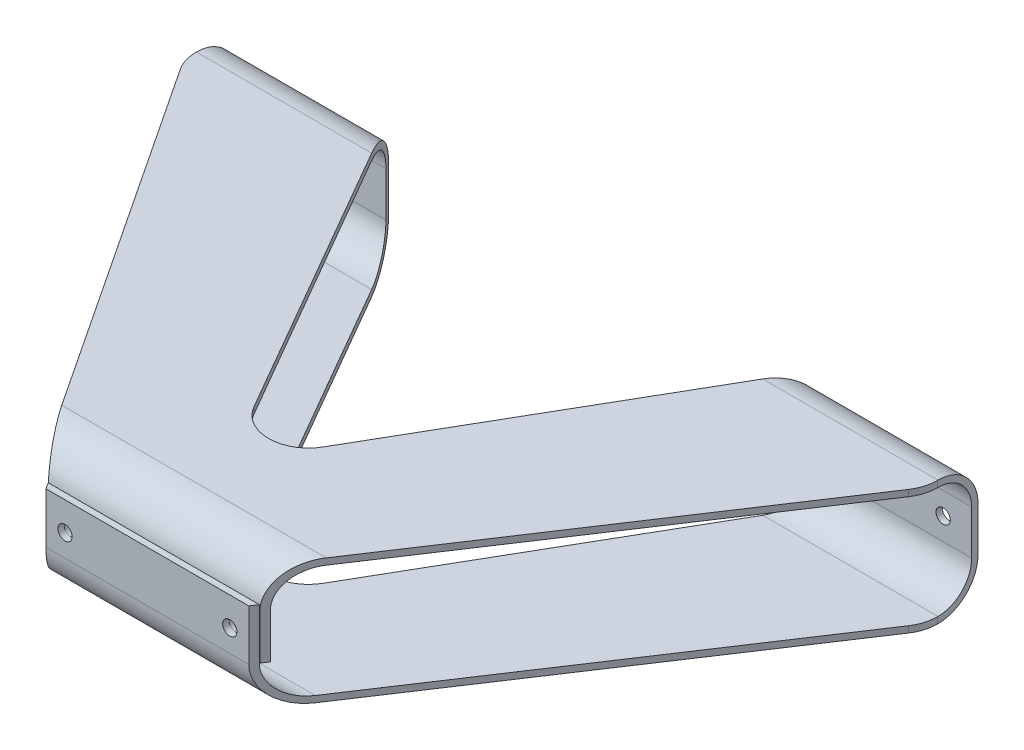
ISO-10303-21;
HEADER;
FILE_DESCRIPTION(('STEP AP214'),'2;1');
FILE_NAME('part.step','',(''),(''),'','','');
FILE_SCHEMA(('AUTOMOTIVE_DESIGN { 1 0 10303 214 1 1 1 1 }'));
ENDSEC;
DATA;
#1=APPLICATION_CONTEXT('core data for automotive mechanical design processes');
#2=APPLICATION_PROTOCOL_DEFINITION('international standard','automotive_design',2000,#1);
#3=PRODUCT_CONTEXT('',#1,'mechanical');
#4=PRODUCT('Part','Part','',(#3));
#5=PRODUCT_RELATED_PRODUCT_CATEGORY('part','',(#4));
#6=PRODUCT_DEFINITION_FORMATION('','',#4);
#7=PRODUCT_DEFINITION_CONTEXT('part definition',#1,'design');
#8=PRODUCT_DEFINITION('design','',#6,#7);
#9=PRODUCT_DEFINITION_SHAPE('','',#8);
#10=(LENGTH_UNIT() NAMED_UNIT(*) SI_UNIT(.MILLI.,.METRE.));
#11=(NAMED_UNIT(*) PLANE_ANGLE_UNIT() SI_UNIT($,.RADIAN.));
#12=(NAMED_UNIT(*) SI_UNIT($,.STERADIAN.) SOLID_ANGLE_UNIT());
#13=UNCERTAINTY_MEASURE_WITH_UNIT(LENGTH_MEASURE(1.E-05),#10,'distance_accuracy_value','');
#14=(GEOMETRIC_REPRESENTATION_CONTEXT(3) GLOBAL_UNCERTAINTY_ASSIGNED_CONTEXT((#13)) GLOBAL_UNIT_ASSIGNED_CONTEXT((#10,
#11,#12)) REPRESENTATION_CONTEXT('',''));
#15=CARTESIAN_POINT('',(0.,0.,0.));
#16=DIRECTION('',(0.,0.,1.));
#17=DIRECTION('',(1.,0.,0.));
#18=AXIS2_PLACEMENT_3D('',#15,#16,#17);
#19=CARTESIAN_POINT('',(371.475,-22.225,-230.365));
#20=DIRECTION('',(0.,0.,1.));
#21=DIRECTION('',(1.,0.,0.));
#22=AXIS2_PLACEMENT_3D('',#19,#20,#21);
#23=PLANE('',#22);
#24=CARTESIAN_POINT('',(-266.7,0.,-230.365012));
#25=DIRECTION('',(0.,0.,-1.));
#26=DIRECTION('',(-1.,0.,0.));
#27=AXIS2_PLACEMENT_3D('',#24,#25,#26);
#28=CIRCLE('',#27,7.14375);
#29=CARTESIAN_POINT('',(-273.84375,0.,-230.365012));
#30=VERTEX_POINT('',#29);
#31=EDGE_CURVE('E2709',#30,#30,#28,.T.);
#32=ORIENTED_EDGE('',*,*,#31,.F.);
#33=EDGE_LOOP('',(#32));
#34=FACE_BOUND('',#33,.T.);
#35=CARTESIAN_POINT('',(-342.9,0.,-230.365012));
#36=DIRECTION('',(0.,0.,-1.));
#37=DIRECTION('',(-1.,0.,0.));
#38=AXIS2_PLACEMENT_3D('',#35,#36,#37);
#39=CIRCLE('',#38,7.14375);
#40=CARTESIAN_POINT('',(-350.04375,0.,-230.365012));
#41=VERTEX_POINT('',#40);
#42=EDGE_CURVE('E2531',#41,#41,#39,.T.);
#43=ORIENTED_EDGE('',*,*,#42,.F.);
#44=EDGE_LOOP('',(#43));
#45=FACE_BOUND('',#44,.T.);
#46=DIRECTION('',(0.,1.,0.));
#47=VECTOR('',#46,1.);
#48=CARTESIAN_POINT('',(-219.075,-62.3250000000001,-230.365));
#49=LINE('',#48,#47);
#50=CARTESIAN_POINT('',(-219.075,-22.225,-230.365));
#51=VERTEX_POINT('',#50);
#52=CARTESIAN_POINT('',(-219.075,22.225,-230.365));
#53=VERTEX_POINT('',#52);
#54=EDGE_CURVE('E2167',#51,#53,#49,.T.);
#55=ORIENTED_EDGE('',*,*,#54,.F.);
#56=DIRECTION('',(-1.,0.,0.));
#57=VECTOR('',#56,1.);
#58=CARTESIAN_POINT('',(371.475,-22.225,-230.365));
#59=LINE('',#58,#57);
#60=CARTESIAN_POINT('',(-371.475,-22.225,-230.365));
#61=VERTEX_POINT('',#60);
#62=EDGE_CURVE('E2775',#51,#61,#59,.T.);
#63=ORIENTED_EDGE('',*,*,#62,.T.);
#64=DIRECTION('',(0.,1.,0.));
#65=VECTOR('',#64,1.);
#66=CARTESIAN_POINT('',(-371.475,-22.225,-230.365));
#67=LINE('',#66,#65);
#68=CARTESIAN_POINT('',(-371.475,22.225,-230.365));
#69=VERTEX_POINT('',#68);
#70=EDGE_CURVE('E3015',#61,#69,#67,.T.);
#71=ORIENTED_EDGE('',*,*,#70,.T.);
#72=DIRECTION('',(-1.,0.,0.));
#73=VECTOR('',#72,1.);
#74=CARTESIAN_POINT('',(371.475,22.225,-230.365));
#75=LINE('',#74,#73);
#76=EDGE_CURVE('E2787',#53,#69,#75,.T.);
#77=ORIENTED_EDGE('',*,*,#76,.F.);
#78=EDGE_LOOP('',(#55,#63,#71,#77));
#79=FACE_BOUND('',#78,.T.);
#80=ADVANCED_FACE('F2155',(#34,#45,#79),#23,.F.);
#81=CARTESIAN_POINT('',(371.475,62.3250000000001,-190.265));
#82=DIRECTION('',(0.,-1.,0.));
#83=DIRECTION('',(0.,0.,-1.));
#84=AXIS2_PLACEMENT_3D('',#81,#82,#83);
#85=PLANE('',#84);
#86=DIRECTION('',(0.500000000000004,0.,0.866025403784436));
#87=VECTOR('',#86,1.);
#88=CARTESIAN_POINT('',(-34.7276186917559,62.3250000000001,88.9340306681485));
#89=LINE('',#88,#87);
#90=CARTESIAN_POINT('',(-195.923254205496,62.325,-190.265));
#91=VERTEX_POINT('',#90);
#92=CARTESIAN_POINT('',(-34.7276186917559,62.3250000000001,88.9340306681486));
#93=VERTEX_POINT('',#92);
#94=EDGE_CURVE('E2407',#91,#93,#89,.T.);
#95=ORIENTED_EDGE('',*,*,#94,.F.);
#96=DIRECTION('',(-1.,0.,0.));
#97=VECTOR('',#96,1.);
#98=CARTESIAN_POINT('',(371.475,62.325,-190.265));
#99=LINE('',#98,#97);
#100=CARTESIAN_POINT('',(-371.475,62.325,-190.265));
#101=VERTEX_POINT('',#100);
#102=EDGE_CURVE('E3092',#91,#101,#99,.T.);
#103=ORIENTED_EDGE('',*,*,#102,.T.);
#104=DIRECTION('',(0.,0.,1.));
#105=VECTOR('',#104,1.);
#106=CARTESIAN_POINT('',(-371.475,62.3250000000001,-190.265));
#107=LINE('',#106,#105);
#108=CARTESIAN_POINT('',(-371.475,62.3250000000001,-189.598874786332));
#109=VERTEX_POINT('',#108);
#110=EDGE_CURVE('E3016',#101,#109,#107,.T.);
#111=ORIENTED_EDGE('',*,*,#110,.T.);
#112=CARTESIAN_POINT('',(-331.475,62.325,-189.598874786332));
#113=DIRECTION('',(0.,-1.,0.));
#114=DIRECTION('',(0.,0.,-1.));
#115=AXIS2_PLACEMENT_3D('',#112,#113,#114);
#116=CIRCLE('',#115,40.);
#117=CARTESIAN_POINT('',(-364.835249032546,62.325,-167.528673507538));
#118=VERTEX_POINT('',#117);
#119=EDGE_CURVE('E2833',#109,#118,#116,.F.);
#120=ORIENTED_EDGE('',*,*,#119,.T.);
#121=DIRECTION('',(-0.551755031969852,0.,-0.834006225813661));
#122=VECTOR('',#121,1.);
#123=CARTESIAN_POINT('',(-417.094603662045,62.325,-246.521386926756));
#124=LINE('',#123,#122);
#125=CARTESIAN_POINT('',(-132.498051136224,62.325,183.661));
#126=VERTEX_POINT('',#125);
#127=EDGE_CURVE('E2877',#126,#118,#124,.T.);
#128=ORIENTED_EDGE('',*,*,#127,.F.);
#129=DIRECTION('',(-1.,0.,0.));
#130=VECTOR('',#129,1.);
#131=CARTESIAN_POINT('',(371.475,62.325,183.661));
#132=LINE('',#131,#130);
#133=CARTESIAN_POINT('',(132.498051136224,62.325,183.661));
#134=VERTEX_POINT('',#133);
#135=EDGE_CURVE('E3095',#134,#126,#132,.T.);
#136=ORIENTED_EDGE('',*,*,#135,.F.);
#137=DIRECTION('',(-0.551755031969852,0.,0.834006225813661));
#138=VECTOR('',#137,1.);
#139=CARTESIAN_POINT('',(418.036818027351,62.325,-247.945592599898));
#140=LINE('',#139,#138);
#141=CARTESIAN_POINT('',(364.835249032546,62.325,-167.528673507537));
#142=VERTEX_POINT('',#141);
#143=EDGE_CURVE('E2587',#142,#134,#140,.T.);
#144=ORIENTED_EDGE('',*,*,#143,.F.);
#145=CARTESIAN_POINT('',(331.475,62.3250000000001,-189.598874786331));
#146=DIRECTION('',(0.,-1.,0.));
#147=DIRECTION('',(0.,0.,-1.));
#148=AXIS2_PLACEMENT_3D('',#145,#146,#147);
#149=CIRCLE('',#148,40.);
#150=CARTESIAN_POINT('',(371.475,62.3250000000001,-189.598874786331));
#151=VERTEX_POINT('',#150);
#152=EDGE_CURVE('E2826',#142,#151,#149,.F.);
#153=ORIENTED_EDGE('',*,*,#152,.T.);
#154=DIRECTION('',(0.,0.,1.));
#155=VECTOR('',#154,1.);
#156=CARTESIAN_POINT('',(371.475,62.3250000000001,-190.265));
#157=LINE('',#156,#155);
#158=CARTESIAN_POINT('',(371.475,62.325,-190.265));
#159=VERTEX_POINT('',#158);
#160=EDGE_CURVE('E2986',#159,#151,#157,.T.);
#161=ORIENTED_EDGE('',*,*,#160,.F.);
#162=CARTESIAN_POINT('',(195.923254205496,62.325,-190.265));
#163=VERTEX_POINT('',#162);
#164=EDGE_CURVE('E3096',#159,#163,#99,.T.);
#165=ORIENTED_EDGE('',*,*,#164,.T.);
#166=DIRECTION('',(0.500000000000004,0.,-0.866025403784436));
#167=VECTOR('',#166,1.);
#168=CARTESIAN_POINT('',(34.7276186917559,62.3250000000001,88.9340306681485));
#169=LINE('',#168,#167);
#170=CARTESIAN_POINT('',(34.7276186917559,62.3250000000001,88.9340306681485));
#171=VERTEX_POINT('',#170);
#172=EDGE_CURVE('E2434',#171,#163,#169,.T.);
#173=ORIENTED_EDGE('',*,*,#172,.F.);
#174=CARTESIAN_POINT('',(0.,62.3250000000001,68.8840306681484));
#175=DIRECTION('',(0.,1.,0.));
#176=DIRECTION('',(0.,0.,-1.));
#177=AXIS2_PLACEMENT_3D('',#174,#175,#176);
#178=CIRCLE('',#177,40.1);
#179=EDGE_CURVE('E2416',#93,#171,#178,.T.);
#180=ORIENTED_EDGE('',*,*,#179,.F.);
#181=EDGE_LOOP('',(#95,#103,#111,#120,#128,#136,#144,#153,#161,#165,#173,#180));
#182=FACE_BOUND('',#181,.T.);
#183=ADVANCED_FACE('F2429',(#182),#85,.F.);
#184=CARTESIAN_POINT('',(371.475,-22.225,-190.265));
#185=DIRECTION('',(-1.,0.,0.));
#186=DIRECTION('',(0.,0.,1.));
#187=AXIS2_PLACEMENT_3D('',#184,#185,#186);
#188=CYLINDRICAL_SURFACE('',#187,40.1);
#189=DIRECTION('',(-1.,0.,0.));
#190=VECTOR('',#189,1.);
#191=CARTESIAN_POINT('',(371.475,-62.3250000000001,-190.265));
#192=LINE('',#191,#190);
#193=CARTESIAN_POINT('',(371.475,-62.3250000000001,-190.265));
#194=VERTEX_POINT('',#193);
#195=CARTESIAN_POINT('',(195.923254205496,-62.325,-190.265));
#196=VERTEX_POINT('',#195);
#197=EDGE_CURVE('E2788',#194,#196,#192,.T.);
#198=ORIENTED_EDGE('',*,*,#197,.T.);
#199=CARTESIAN_POINT('',(195.923254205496,-22.225,-190.265));
#200=DIRECTION('',(0.866025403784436,0.,0.500000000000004));
#201=DIRECTION('',(-0.500000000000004,0.,0.866025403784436));
#202=AXIS2_PLACEMENT_3D('',#199,#200,#201);
#203=ELLIPSE('',#202,46.3034915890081,40.1);
#204=CARTESIAN_POINT('',(219.075,-22.225,-230.365));
#205=VERTEX_POINT('',#204);
#206=EDGE_CURVE('E2504',#196,#205,#203,.T.);
#207=ORIENTED_EDGE('',*,*,#206,.T.);
#208=CARTESIAN_POINT('',(371.475,-22.225,-230.365));
#209=VERTEX_POINT('',#208);
#210=EDGE_CURVE('E2778',#209,#205,#59,.T.);
#211=ORIENTED_EDGE('',*,*,#210,.F.);
#212=CARTESIAN_POINT('',(371.475,-22.225,-190.265));
#213=DIRECTION('',(1.,0.,0.));
#214=DIRECTION('',(0.,0.,-1.));
#215=AXIS2_PLACEMENT_3D('',#212,#213,#214);
#216=CIRCLE('',#215,40.1);
#217=EDGE_CURVE('E2980',#194,#209,#216,.T.);
#218=ORIENTED_EDGE('',*,*,#217,.F.);
#219=EDGE_LOOP('',(#198,#207,#211,#218));
#220=FACE_BOUND('',#219,.T.);
#221=ADVANCED_FACE('F2675',(#220),#188,.T.);
#222=CARTESIAN_POINT('',(371.475,22.225,-190.265));
#223=DIRECTION('',(-1.,0.,0.));
#224=DIRECTION('',(0.,0.,1.));
#225=AXIS2_PLACEMENT_3D('',#222,#223,#224);
#226=CYLINDRICAL_SURFACE('',#225,40.1);
#227=CARTESIAN_POINT('',(371.475,22.225,-230.365));
#228=VERTEX_POINT('',#227);
#229=CARTESIAN_POINT('',(219.075,22.225,-230.365));
#230=VERTEX_POINT('',#229);
#231=EDGE_CURVE('E2777',#228,#230,#75,.T.);
#232=ORIENTED_EDGE('',*,*,#231,.T.);
#233=CARTESIAN_POINT('',(195.923254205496,22.225,-190.265));
#234=DIRECTION('',(0.866025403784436,0.,0.500000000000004));
#235=DIRECTION('',(-0.500000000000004,0.,0.866025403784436));
#236=AXIS2_PLACEMENT_3D('',#233,#234,#235);
#237=ELLIPSE('',#236,46.3034915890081,40.1);
#238=EDGE_CURVE('E2503',#230,#163,#237,.T.);
#239=ORIENTED_EDGE('',*,*,#238,.T.);
#240=ORIENTED_EDGE('',*,*,#164,.F.);
#241=CARTESIAN_POINT('',(371.475,22.225,-190.265));
#242=DIRECTION('',(1.,0.,0.));
#243=DIRECTION('',(0.,0.,-1.));
#244=AXIS2_PLACEMENT_3D('',#241,#242,#243);
#245=CIRCLE('',#244,40.1);
#246=EDGE_CURVE('E2981',#228,#159,#245,.T.);
#247=ORIENTED_EDGE('',*,*,#246,.F.);
#248=EDGE_LOOP('',(#232,#239,#240,#247));
#249=FACE_BOUND('',#248,.T.);
#250=ADVANCED_FACE('F2680',(#249),#226,.T.);
#251=CARTESIAN_POINT('',(371.475,22.225,-190.265));
#252=DIRECTION('',(-1.,0.,0.));
#253=DIRECTION('',(0.,0.,1.));
#254=AXIS2_PLACEMENT_3D('',#251,#252,#253);
#255=CYLINDRICAL_SURFACE('',#254,33.75);
#256=DIRECTION('',(-1.,0.,0.));
#257=VECTOR('',#256,1.);
#258=CARTESIAN_POINT('',(371.475,55.975,-190.265));
#259=LINE('',#258,#257);
#260=CARTESIAN_POINT('',(371.475,55.975,-190.265));
#261=VERTEX_POINT('',#260);
#262=CARTESIAN_POINT('',(195.923254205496,55.975,-190.265));
#263=VERTEX_POINT('',#262);
#264=EDGE_CURVE('E3066',#261,#263,#259,.T.);
#265=ORIENTED_EDGE('',*,*,#264,.T.);
#266=CARTESIAN_POINT('',(195.923254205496,22.225,-190.265));
#267=DIRECTION('',(0.866025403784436,0.,0.500000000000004));
#268=DIRECTION('',(-0.500000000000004,0.,0.866025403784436));
#269=AXIS2_PLACEMENT_3D('',#266,#267,#268);
#270=ELLIPSE('',#269,38.9711431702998,33.75);
#271=CARTESIAN_POINT('',(215.408825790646,22.225,-224.015));
#272=VERTEX_POINT('',#271);
#273=EDGE_CURVE('E2492',#263,#272,#270,.F.);
#274=ORIENTED_EDGE('',*,*,#273,.T.);
#275=DIRECTION('',(-1.,0.,0.));
#276=VECTOR('',#275,1.);
#277=CARTESIAN_POINT('',(371.475,22.225,-224.015));
#278=LINE('',#277,#276);
#279=CARTESIAN_POINT('',(371.475,22.225,-224.015));
#280=VERTEX_POINT('',#279);
#281=EDGE_CURVE('E3061',#280,#272,#278,.T.);
#282=ORIENTED_EDGE('',*,*,#281,.F.);
#283=CARTESIAN_POINT('',(371.475,22.225,-190.265));
#284=DIRECTION('',(-1.,0.,0.));
#285=DIRECTION('',(0.,0.,-1.));
#286=AXIS2_PLACEMENT_3D('',#283,#284,#285);
#287=CIRCLE('',#286,33.75);
#288=EDGE_CURVE('E2993',#261,#280,#287,.T.);
#289=ORIENTED_EDGE('',*,*,#288,.F.);
#290=EDGE_LOOP('',(#265,#274,#282,#289));
#291=FACE_BOUND('',#290,.T.);
#292=ADVANCED_FACE('F2644',(#291),#255,.F.);
#293=CARTESIAN_POINT('',(371.475,-22.225,-224.015));
#294=DIRECTION('',(0.,0.,-1.));
#295=DIRECTION('',(0.,1.,0.));
#296=AXIS2_PLACEMENT_3D('',#293,#294,#295);
#297=PLANE('',#296);
#298=CARTESIAN_POINT('',(342.9,0.,-224.015));
#299=DIRECTION('',(0.,0.,-1.));
#300=DIRECTION('',(0.,1.,0.));
#301=AXIS2_PLACEMENT_3D('',#298,#299,#300);
#302=CIRCLE('',#301,7.14375000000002);
#303=CARTESIAN_POINT('',(342.9,7.14375000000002,-224.015));
#304=VERTEX_POINT('',#303);
#305=EDGE_CURVE('E2722',#304,#304,#302,.F.);
#306=ORIENTED_EDGE('',*,*,#305,.F.);
#307=EDGE_LOOP('',(#306));
#308=FACE_BOUND('',#307,.T.);
#309=CARTESIAN_POINT('',(266.7,0.,-224.015));
#310=DIRECTION('',(0.,0.,-1.));
#311=DIRECTION('',(0.,1.,0.));
#312=AXIS2_PLACEMENT_3D('',#309,#310,#311);
#313=CIRCLE('',#312,7.14375000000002);
#314=CARTESIAN_POINT('',(266.7,7.14375000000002,-224.015));
#315=VERTEX_POINT('',#314);
#316=EDGE_CURVE('E2729',#315,#315,#313,.F.);
#317=ORIENTED_EDGE('',*,*,#316,.F.);
#318=EDGE_LOOP('',(#317));
#319=FACE_BOUND('',#318,.T.);
#320=ORIENTED_EDGE('',*,*,#281,.T.);
#321=DIRECTION('',(0.,-1.,0.));
#322=VECTOR('',#321,1.);
#323=CARTESIAN_POINT('',(215.408825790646,-22.2250000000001,-224.015));
#324=LINE('',#323,#322);
#325=CARTESIAN_POINT('',(215.408825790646,-22.225,-224.015));
#326=VERTEX_POINT('',#325);
#327=EDGE_CURVE('E2488',#272,#326,#324,.T.);
#328=ORIENTED_EDGE('',*,*,#327,.T.);
#329=DIRECTION('',(-1.,0.,0.));
#330=VECTOR('',#329,1.);
#331=CARTESIAN_POINT('',(371.475,-22.225,-224.015));
#332=LINE('',#331,#330);
#333=CARTESIAN_POINT('',(371.475,-22.225,-224.015));
#334=VERTEX_POINT('',#333);
#335=EDGE_CURVE('E3057',#334,#326,#332,.T.);
#336=ORIENTED_EDGE('',*,*,#335,.F.);
#337=DIRECTION('',(0.,-1.,0.));
#338=VECTOR('',#337,1.);
#339=CARTESIAN_POINT('',(371.475,-22.225,-224.015));
#340=LINE('',#339,#338);
#341=EDGE_CURVE('E3000',#280,#334,#340,.T.);
#342=ORIENTED_EDGE('',*,*,#341,.F.);
#343=EDGE_LOOP('',(#320,#328,#336,#342));
#344=FACE_BOUND('',#343,.T.);
#345=ADVANCED_FACE('F2637',(#308,#319,#344),#297,.F.);
#346=CARTESIAN_POINT('',(371.475,-22.225,-190.265));
#347=DIRECTION('',(-1.,0.,0.));
#348=DIRECTION('',(0.,0.,1.));
#349=AXIS2_PLACEMENT_3D('',#346,#347,#348);
#350=CYLINDRICAL_SURFACE('',#349,33.75);
#351=ORIENTED_EDGE('',*,*,#335,.T.);
#352=CARTESIAN_POINT('',(195.923254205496,-22.225,-190.265));
#353=DIRECTION('',(0.866025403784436,0.,0.500000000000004));
#354=DIRECTION('',(-0.500000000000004,0.,0.866025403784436));
#355=AXIS2_PLACEMENT_3D('',#352,#353,#354);
#356=ELLIPSE('',#355,38.9711431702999,33.75);
#357=CARTESIAN_POINT('',(195.923254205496,-55.975,-190.265));
#358=VERTEX_POINT('',#357);
#359=EDGE_CURVE('E2483',#326,#358,#356,.F.);
#360=ORIENTED_EDGE('',*,*,#359,.T.);
#361=DIRECTION('',(-1.,0.,0.));
#362=VECTOR('',#361,1.);
#363=CARTESIAN_POINT('',(371.475,-55.975,-190.265));
#364=LINE('',#363,#362);
#365=CARTESIAN_POINT('',(371.475,-55.975,-190.265));
#366=VERTEX_POINT('',#365);
#367=EDGE_CURVE('E3053',#366,#358,#364,.T.);
#368=ORIENTED_EDGE('',*,*,#367,.F.);
#369=CARTESIAN_POINT('',(371.475,-22.225,-190.265));
#370=DIRECTION('',(-1.,0.,0.));
#371=DIRECTION('',(0.,0.,-1.));
#372=AXIS2_PLACEMENT_3D('',#369,#370,#371);
#373=CIRCLE('',#372,33.75);
#374=EDGE_CURVE('E2999',#334,#366,#373,.T.);
#375=ORIENTED_EDGE('',*,*,#374,.F.);
#376=EDGE_LOOP('',(#351,#360,#368,#375));
#377=FACE_BOUND('',#376,.T.);
#378=ADVANCED_FACE('F2634',(#377),#350,.F.);
#379=ORIENTED_EDGE('',*,*,#210,.T.);
#380=DIRECTION('',(0.,1.,0.));
#381=VECTOR('',#380,1.);
#382=CARTESIAN_POINT('',(219.075,-62.3250000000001,-230.365));
#383=LINE('',#382,#381);
#384=EDGE_CURVE('E2451',#205,#230,#383,.T.);
#385=ORIENTED_EDGE('',*,*,#384,.T.);
#386=ORIENTED_EDGE('',*,*,#231,.F.);
#387=DIRECTION('',(0.,1.,0.));
#388=VECTOR('',#387,1.);
#389=CARTESIAN_POINT('',(371.475,-22.225,-230.365));
#390=LINE('',#389,#388);
#391=EDGE_CURVE('E2982',#209,#228,#390,.T.);
#392=ORIENTED_EDGE('',*,*,#391,.F.);
#393=EDGE_LOOP('',(#379,#385,#386,#392));
#394=FACE_BOUND('',#393,.T.);
#395=CARTESIAN_POINT('',(342.9,0.,-230.365012));
#396=DIRECTION('',(0.,0.,-1.));
#397=DIRECTION('',(-1.,0.,0.));
#398=AXIS2_PLACEMENT_3D('',#395,#396,#397);
#399=CIRCLE('',#398,7.14375);
#400=CARTESIAN_POINT('',(335.75625,0.,-230.365012));
#401=VERTEX_POINT('',#400);
#402=EDGE_CURVE('E2582',#401,#401,#399,.T.);
#403=ORIENTED_EDGE('',*,*,#402,.F.);
#404=EDGE_LOOP('',(#403));
#405=FACE_BOUND('',#404,.T.);
#406=CARTESIAN_POINT('',(266.7,0.,-230.365012));
#407=DIRECTION('',(0.,0.,-1.));
#408=DIRECTION('',(-1.,0.,0.));
#409=AXIS2_PLACEMENT_3D('',#406,#407,#408);
#410=CIRCLE('',#409,7.14375);
#411=CARTESIAN_POINT('',(259.55625,0.,-230.365012));
#412=VERTEX_POINT('',#411);
#413=EDGE_CURVE('E2573',#412,#412,#410,.T.);
#414=ORIENTED_EDGE('',*,*,#413,.F.);
#415=EDGE_LOOP('',(#414));
#416=FACE_BOUND('',#415,.T.);
#417=ADVANCED_FACE('F2676',(#394,#405,#416),#23,.F.);
#418=CARTESIAN_POINT('',(371.475,28.575,230.365));
#419=DIRECTION('',(0.,0.,-1.));
#420=DIRECTION('',(-1.,0.,0.));
#421=AXIS2_PLACEMENT_3D('',#418,#419,#420);
#422=PLANE('',#421);
#423=CARTESIAN_POINT('',(-82.55,0.,230.365));
#424=DIRECTION('',(0.,0.,1.));
#425=DIRECTION('',(1.,0.,0.));
#426=AXIS2_PLACEMENT_3D('',#423,#424,#425);
#427=CIRCLE('',#426,7.14375);
#428=CARTESIAN_POINT('',(-75.40625,0.,230.365));
#429=VERTEX_POINT('',#428);
#430=EDGE_CURVE('E2518',#429,#429,#427,.T.);
#431=ORIENTED_EDGE('',*,*,#430,.F.);
#432=EDGE_LOOP('',(#431));
#433=FACE_BOUND('',#432,.T.);
#434=CARTESIAN_POINT('',(82.55,0.,230.365));
#435=DIRECTION('',(0.,0.,1.));
#436=DIRECTION('',(1.,0.,0.));
#437=AXIS2_PLACEMENT_3D('',#434,#435,#436);
#438=CIRCLE('',#437,7.14375000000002);
#439=CARTESIAN_POINT('',(89.6937500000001,0.,230.365));
#440=VERTEX_POINT('',#439);
#441=EDGE_CURVE('E2522',#440,#440,#438,.T.);
#442=ORIENTED_EDGE('',*,*,#441,.F.);
#443=EDGE_LOOP('',(#442));
#444=FACE_BOUND('',#443,.T.);
#445=DIRECTION('',(-1.,0.,0.));
#446=VECTOR('',#445,1.);
#447=CARTESIAN_POINT('',(371.475,-22.225,230.365));
#448=LINE('',#447,#446);
#449=CARTESIAN_POINT('',(101.6,-22.225,230.365));
#450=VERTEX_POINT('',#449);
#451=CARTESIAN_POINT('',(-101.6,-22.225,230.365));
#452=VERTEX_POINT('',#451);
#453=EDGE_CURVE('E2800',#450,#452,#448,.T.);
#454=ORIENTED_EDGE('',*,*,#453,.F.);
#455=DIRECTION('',(0.,1.,0.));
#456=VECTOR('',#455,1.);
#457=CARTESIAN_POINT('',(101.6,-62.3250000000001,230.365));
#458=LINE('',#457,#456);
#459=CARTESIAN_POINT('',(101.6,28.575,230.365));
#460=VERTEX_POINT('',#459);
#461=EDGE_CURVE('E2882',#450,#460,#458,.T.);
#462=ORIENTED_EDGE('',*,*,#461,.T.);
#463=DIRECTION('',(-1.,0.,0.));
#464=VECTOR('',#463,1.);
#465=CARTESIAN_POINT('',(371.475,28.575,230.365));
#466=LINE('',#465,#464);
#467=CARTESIAN_POINT('',(-101.6,28.575,230.365));
#468=VERTEX_POINT('',#467);
#469=EDGE_CURVE('E2803',#460,#468,#466,.T.);
#470=ORIENTED_EDGE('',*,*,#469,.T.);
#471=DIRECTION('',(0.,1.,0.));
#472=VECTOR('',#471,1.);
#473=CARTESIAN_POINT('',(-101.6,-62.3250000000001,230.365));
#474=LINE('',#473,#472);
#475=EDGE_CURVE('E2868',#452,#468,#474,.T.);
#476=ORIENTED_EDGE('',*,*,#475,.F.);
#477=EDGE_LOOP('',(#454,#462,#470,#476));
#478=FACE_BOUND('',#477,.T.);
#479=ADVANCED_FACE('F2681',(#433,#444,#478),#422,.F.);
#480=CARTESIAN_POINT('',(371.475,28.575,230.365));
#481=DIRECTION('',(0.,-1.,0.));
#482=DIRECTION('',(0.,0.,-1.));
#483=AXIS2_PLACEMENT_3D('',#480,#481,#482);
#484=PLANE('',#483);
#485=ORIENTED_EDGE('',*,*,#469,.F.);
#486=DIRECTION('',(0.551755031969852,0.,-0.834006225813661));
#487=VECTOR('',#486,1.);
#488=CARTESIAN_POINT('',(183.759021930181,28.575,106.177395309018));
#489=LINE('',#488,#487);
#490=CARTESIAN_POINT('',(105.800981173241,28.575,224.015));
#491=VERTEX_POINT('',#490);
#492=EDGE_CURVE('E2962',#460,#491,#489,.T.);
#493=ORIENTED_EDGE('',*,*,#492,.T.);
#494=DIRECTION('',(-1.,0.,0.));
#495=VECTOR('',#494,1.);
#496=CARTESIAN_POINT('',(371.475,28.575,224.015));
#497=LINE('',#496,#495);
#498=CARTESIAN_POINT('',(-105.800981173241,28.575,224.015));
#499=VERTEX_POINT('',#498);
#500=EDGE_CURVE('E3006',#491,#499,#497,.T.);
#501=ORIENTED_EDGE('',*,*,#500,.T.);
#502=DIRECTION('',(0.551755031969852,0.,0.834006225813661));
#503=VECTOR('',#502,1.);
#504=CARTESIAN_POINT('',(42.4199325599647,28.575,448.058565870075));
#505=LINE('',#504,#503);
#506=EDGE_CURVE('E2925',#499,#468,#505,.T.);
#507=ORIENTED_EDGE('',*,*,#506,.T.);
#508=EDGE_LOOP('',(#485,#493,#501,#507));
#509=FACE_BOUND('',#508,.T.);
#510=ADVANCED_FACE('F3159',(#509),#484,.F.);
#511=CARTESIAN_POINT('',(371.475,-22.225,190.265));
#512=DIRECTION('',(-1.,0.,0.));
#513=DIRECTION('',(0.,0.,1.));
#514=AXIS2_PLACEMENT_3D('',#511,#512,#513);
#515=CYLINDRICAL_SURFACE('',#514,40.1);
#516=DIRECTION('',(-1.,0.,0.));
#517=VECTOR('',#516,1.);
#518=CARTESIAN_POINT('',(371.475,-62.325,190.265));
#519=LINE('',#518,#517);
#520=CARTESIAN_POINT('',(128.129030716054,-62.325,190.265));
#521=VERTEX_POINT('',#520);
#522=CARTESIAN_POINT('',(-128.129030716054,-62.325,190.265));
#523=VERTEX_POINT('',#522);
#524=EDGE_CURVE('E2795',#521,#523,#519,.T.);
#525=ORIENTED_EDGE('',*,*,#524,.F.);
#526=CARTESIAN_POINT('',(128.129030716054,-22.225,190.265));
#527=DIRECTION('',(-0.834006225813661,0.,-0.551755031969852));
#528=DIRECTION('',(-0.551755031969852,0.,0.834006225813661));
#529=AXIS2_PLACEMENT_3D('',#526,#527,#528);
#530=ELLIPSE('',#529,48.0811758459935,40.1);
#531=EDGE_CURVE('E2967',#521,#450,#530,.T.);
#532=ORIENTED_EDGE('',*,*,#531,.T.);
#533=ORIENTED_EDGE('',*,*,#453,.T.);
#534=CARTESIAN_POINT('',(-128.129030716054,-22.225,190.265));
#535=DIRECTION('',(0.834006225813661,0.,-0.551755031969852));
#536=DIRECTION('',(-0.551755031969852,0.,-0.834006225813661));
#537=AXIS2_PLACEMENT_3D('',#534,#535,#536);
#538=ELLIPSE('',#537,48.0811758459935,40.1);
#539=EDGE_CURVE('E2926',#452,#523,#538,.T.);
#540=ORIENTED_EDGE('',*,*,#539,.T.);
#541=EDGE_LOOP('',(#525,#532,#533,#540));
#542=FACE_BOUND('',#541,.T.);
#543=ADVANCED_FACE('F3172',(#542),#515,.T.);
#544=CARTESIAN_POINT('',(371.475,-62.3250000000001,190.265));
#545=DIRECTION('',(0.,1.,0.));
#546=DIRECTION('',(0.,0.,1.));
#547=AXIS2_PLACEMENT_3D('',#544,#545,#546);
#548=PLANE('',#547);
#549=CARTESIAN_POINT('',(0.,-62.3250000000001,68.8840306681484));
#550=DIRECTION('',(0.,1.,0.));
#551=DIRECTION('',(0.,0.,-1.));
#552=AXIS2_PLACEMENT_3D('',#549,#550,#551);
#553=CIRCLE('',#552,40.1);
#554=CARTESIAN_POINT('',(-34.7276186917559,-62.3250000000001,88.9340306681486));
#555=VERTEX_POINT('',#554);
#556=CARTESIAN_POINT('',(34.7276186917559,-62.3250000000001,88.9340306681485));
#557=VERTEX_POINT('',#556);
#558=EDGE_CURVE('E2441',#555,#557,#553,.T.);
#559=ORIENTED_EDGE('',*,*,#558,.T.);
#560=DIRECTION('',(0.500000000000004,0.,-0.866025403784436));
#561=VECTOR('',#560,1.);
#562=CARTESIAN_POINT('',(34.7276186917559,-62.3250000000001,88.9340306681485));
#563=LINE('',#562,#561);
#564=EDGE_CURVE('E2450',#557,#196,#563,.T.);
#565=ORIENTED_EDGE('',*,*,#564,.T.);
#566=ORIENTED_EDGE('',*,*,#197,.F.);
#567=DIRECTION('',(0.,0.,-1.));
#568=VECTOR('',#567,1.);
#569=CARTESIAN_POINT('',(371.475,-62.3250000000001,190.265));
#570=LINE('',#569,#568);
#571=CARTESIAN_POINT('',(371.475,-62.3250000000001,-189.598874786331));
#572=VERTEX_POINT('',#571);
#573=EDGE_CURVE('E2972',#572,#194,#570,.T.);
#574=ORIENTED_EDGE('',*,*,#573,.F.);
#575=CARTESIAN_POINT('',(331.475,-62.3250000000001,-189.598874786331));
#576=DIRECTION('',(0.,1.,0.));
#577=DIRECTION('',(0.,0.,1.));
#578=AXIS2_PLACEMENT_3D('',#575,#576,#577);
#579=CIRCLE('',#578,40.);
#580=CARTESIAN_POINT('',(364.835249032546,-62.3250000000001,-167.528673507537));
#581=VERTEX_POINT('',#580);
#582=EDGE_CURVE('E2824',#572,#581,#579,.F.);
#583=ORIENTED_EDGE('',*,*,#582,.T.);
#584=DIRECTION('',(-0.551755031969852,0.,0.834006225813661));
#585=VECTOR('',#584,1.);
#586=CARTESIAN_POINT('',(418.036818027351,-62.3250000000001,-247.945592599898));
#587=LINE('',#586,#585);
#588=EDGE_CURVE('E3146',#581,#521,#587,.T.);
#589=ORIENTED_EDGE('',*,*,#588,.T.);
#590=ORIENTED_EDGE('',*,*,#524,.T.);
#591=DIRECTION('',(-0.551755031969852,0.,-0.834006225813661));
#592=VECTOR('',#591,1.);
#593=CARTESIAN_POINT('',(-417.094603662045,-62.3250000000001,-246.521386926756));
#594=LINE('',#593,#592);
#595=CARTESIAN_POINT('',(-364.835249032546,-62.3250000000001,-167.528673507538));
#596=VERTEX_POINT('',#595);
#597=EDGE_CURVE('E2871',#523,#596,#594,.T.);
#598=ORIENTED_EDGE('',*,*,#597,.T.);
#599=CARTESIAN_POINT('',(-331.475,-62.3250000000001,-189.598874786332));
#600=DIRECTION('',(0.,1.,0.));
#601=DIRECTION('',(0.,0.,1.));
#602=AXIS2_PLACEMENT_3D('',#599,#600,#601);
#603=CIRCLE('',#602,40.);
#604=CARTESIAN_POINT('',(-371.475,-62.3250000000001,-189.598874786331));
#605=VERTEX_POINT('',#604);
#606=EDGE_CURVE('E2823',#596,#605,#603,.F.);
#607=ORIENTED_EDGE('',*,*,#606,.T.);
#608=DIRECTION('',(0.,0.,-1.));
#609=VECTOR('',#608,1.);
#610=CARTESIAN_POINT('',(-371.475,-62.3250000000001,190.265));
#611=LINE('',#610,#609);
#612=CARTESIAN_POINT('',(-371.475,-62.3250000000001,-190.265));
#613=VERTEX_POINT('',#612);
#614=EDGE_CURVE('E2973',#605,#613,#611,.T.);
#615=ORIENTED_EDGE('',*,*,#614,.T.);
#616=CARTESIAN_POINT('',(-195.923254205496,-62.325,-190.265));
#617=VERTEX_POINT('',#616);
#618=EDGE_CURVE('E2766',#617,#613,#192,.T.);
#619=ORIENTED_EDGE('',*,*,#618,.F.);
#620=DIRECTION('',(0.500000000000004,0.,0.866025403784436));
#621=VECTOR('',#620,1.);
#622=CARTESIAN_POINT('',(-34.7276186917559,-62.3250000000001,88.9340306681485));
#623=LINE('',#622,#621);
#624=EDGE_CURVE('E2437',#617,#555,#623,.T.);
#625=ORIENTED_EDGE('',*,*,#624,.T.);
#626=EDGE_LOOP('',(#559,#565,#566,#574,#583,#589,#590,#598,#607,#615,#619,#625));
#627=FACE_BOUND('',#626,.T.);
#628=ADVANCED_FACE('F2764',(#627),#548,.F.);
#629=ORIENTED_EDGE('',*,*,#62,.F.);
#630=CARTESIAN_POINT('',(-195.923254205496,-22.225,-190.265));
#631=DIRECTION('',(-0.866025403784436,0.,0.500000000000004));
#632=DIRECTION('',(-0.500000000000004,0.,-0.866025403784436));
#633=AXIS2_PLACEMENT_3D('',#630,#631,#632);
#634=ELLIPSE('',#633,46.3034915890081,40.1);
#635=EDGE_CURVE('E2477',#51,#617,#634,.T.);
#636=ORIENTED_EDGE('',*,*,#635,.T.);
#637=ORIENTED_EDGE('',*,*,#618,.T.);
#638=CARTESIAN_POINT('',(-371.475,-22.225,-190.265));
#639=DIRECTION('',(1.,0.,0.));
#640=DIRECTION('',(0.,0.,-1.));
#641=AXIS2_PLACEMENT_3D('',#638,#639,#640);
#642=CIRCLE('',#641,40.1);
#643=EDGE_CURVE('E2772',#613,#61,#642,.T.);
#644=ORIENTED_EDGE('',*,*,#643,.T.);
#645=EDGE_LOOP('',(#629,#636,#637,#644));
#646=FACE_BOUND('',#645,.T.);
#647=ADVANCED_FACE('F2674',(#646),#188,.T.);
#648=ORIENTED_EDGE('',*,*,#102,.F.);
#649=CARTESIAN_POINT('',(-195.923254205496,22.225,-190.265));
#650=DIRECTION('',(-0.866025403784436,0.,0.500000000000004));
#651=DIRECTION('',(-0.500000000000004,0.,-0.866025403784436));
#652=AXIS2_PLACEMENT_3D('',#649,#650,#651);
#653=ELLIPSE('',#652,46.3034915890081,40.1);
#654=EDGE_CURVE('E2411',#91,#53,#653,.T.);
#655=ORIENTED_EDGE('',*,*,#654,.T.);
#656=ORIENTED_EDGE('',*,*,#76,.T.);
#657=CARTESIAN_POINT('',(-371.475,22.225,-190.265));
#658=DIRECTION('',(1.,0.,0.));
#659=DIRECTION('',(0.,0.,-1.));
#660=AXIS2_PLACEMENT_3D('',#657,#658,#659);
#661=CIRCLE('',#660,40.1);
#662=EDGE_CURVE('E3014',#69,#101,#661,.T.);
#663=ORIENTED_EDGE('',*,*,#662,.T.);
#664=EDGE_LOOP('',(#648,#655,#656,#663));
#665=FACE_BOUND('',#664,.T.);
#666=ADVANCED_FACE('F2667',(#665),#226,.T.);
#667=CARTESIAN_POINT('',(371.475,22.225,183.661));
#668=DIRECTION('',(-1.,0.,0.));
#669=DIRECTION('',(0.,0.,1.));
#670=AXIS2_PLACEMENT_3D('',#667,#668,#669);
#671=CYLINDRICAL_SURFACE('',#670,40.1);
#672=DIRECTION('',(-1.,0.,0.));
#673=VECTOR('',#672,1.);
#674=CARTESIAN_POINT('',(371.475,22.225,223.761));
#675=LINE('',#674,#673);
#676=CARTESIAN_POINT('',(105.96902042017,22.225,223.761));
#677=VERTEX_POINT('',#676);
#678=CARTESIAN_POINT('',(-105.96902042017,22.225,223.761));
#679=VERTEX_POINT('',#678);
#680=EDGE_CURVE('E3086',#677,#679,#675,.T.);
#681=ORIENTED_EDGE('',*,*,#680,.F.);
#682=CARTESIAN_POINT('',(132.498051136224,22.225,183.661));
#683=DIRECTION('',(-0.834006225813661,0.,-0.551755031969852));
#684=DIRECTION('',(-0.551755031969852,0.,0.834006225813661));
#685=AXIS2_PLACEMENT_3D('',#682,#683,#684);
#686=ELLIPSE('',#685,48.0811758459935,40.1);
#687=EDGE_CURVE('E2948',#677,#134,#686,.T.);
#688=ORIENTED_EDGE('',*,*,#687,.T.);
#689=ORIENTED_EDGE('',*,*,#135,.T.);
#690=CARTESIAN_POINT('',(-132.498051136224,22.225,183.661));
#691=DIRECTION('',(0.834006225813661,0.,-0.551755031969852));
#692=DIRECTION('',(-0.551755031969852,0.,-0.834006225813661));
#693=AXIS2_PLACEMENT_3D('',#690,#691,#692);
#694=ELLIPSE('',#693,48.0811758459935,40.1);
#695=EDGE_CURVE('E2908',#126,#679,#694,.T.);
#696=ORIENTED_EDGE('',*,*,#695,.T.);
#697=EDGE_LOOP('',(#681,#688,#689,#696));
#698=FACE_BOUND('',#697,.T.);
#699=ADVANCED_FACE('F2663',(#698),#671,.T.);
#700=CARTESIAN_POINT('',(371.475,22.225,223.761));
#701=DIRECTION('',(0.,0.,-1.));
#702=DIRECTION('',(-1.,0.,0.));
#703=AXIS2_PLACEMENT_3D('',#700,#701,#702);
#704=PLANE('',#703);
#705=CARTESIAN_POINT('',(82.55,1.63008277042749E-13,223.761));
#706=DIRECTION('',(0.,0.,1.));
#707=DIRECTION('',(1.,0.,0.));
#708=AXIS2_PLACEMENT_3D('',#705,#706,#707);
#709=CIRCLE('',#708,8.14375);
#710=CARTESIAN_POINT('',(90.69375,1.63008277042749E-13,223.761));
#711=VERTEX_POINT('',#710);
#712=EDGE_CURVE('E2507',#711,#711,#709,.T.);
#713=ORIENTED_EDGE('',*,*,#712,.F.);
#714=EDGE_LOOP('',(#713));
#715=FACE_BOUND('',#714,.T.);
#716=CARTESIAN_POINT('',(-82.55,1.63008277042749E-13,223.761));
#717=DIRECTION('',(0.,0.,1.));
#718=DIRECTION('',(1.,0.,0.));
#719=AXIS2_PLACEMENT_3D('',#716,#717,#718);
#720=CIRCLE('',#719,8.14375);
#721=CARTESIAN_POINT('',(-74.40625,1.63008277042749E-13,223.761));
#722=VERTEX_POINT('',#721);
#723=EDGE_CURVE('E2509',#722,#722,#720,.T.);
#724=ORIENTED_EDGE('',*,*,#723,.F.);
#725=EDGE_LOOP('',(#724));
#726=FACE_BOUND('',#725,.T.);
#727=DIRECTION('',(-1.,0.,0.));
#728=VECTOR('',#727,1.);
#729=CARTESIAN_POINT('',(371.475,-22.225,223.761));
#730=LINE('',#729,#728);
#731=CARTESIAN_POINT('',(105.96902042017,-22.225,223.761));
#732=VERTEX_POINT('',#731);
#733=CARTESIAN_POINT('',(-105.96902042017,-22.225,223.761));
#734=VERTEX_POINT('',#733);
#735=EDGE_CURVE('E3081',#732,#734,#730,.T.);
#736=ORIENTED_EDGE('',*,*,#735,.F.);
#737=DIRECTION('',(0.,1.,0.));
#738=VECTOR('',#737,1.);
#739=CARTESIAN_POINT('',(105.96902042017,22.225,223.761));
#740=LINE('',#739,#738);
#741=EDGE_CURVE('E2942',#732,#677,#740,.T.);
#742=ORIENTED_EDGE('',*,*,#741,.T.);
#743=ORIENTED_EDGE('',*,*,#680,.T.);
#744=DIRECTION('',(0.,-1.,0.));
#745=VECTOR('',#744,1.);
#746=CARTESIAN_POINT('',(-105.96902042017,22.225,223.761));
#747=LINE('',#746,#745);
#748=EDGE_CURVE('E2902',#679,#734,#747,.T.);
#749=ORIENTED_EDGE('',*,*,#748,.T.);
#750=EDGE_LOOP('',(#736,#742,#743,#749));
#751=FACE_BOUND('',#750,.T.);
#752=ADVANCED_FACE('F2658',(#715,#726,#751),#704,.F.);
#753=CARTESIAN_POINT('',(371.475,-22.225,223.761));
#754=DIRECTION('',(0.,1.,0.));
#755=DIRECTION('',(0.,0.,1.));
#756=AXIS2_PLACEMENT_3D('',#753,#754,#755);
#757=PLANE('',#756);
#758=DIRECTION('',(-1.,0.,0.));
#759=VECTOR('',#758,1.);
#760=CARTESIAN_POINT('',(371.475,-22.225,217.411));
#761=LINE('',#760,#759);
#762=CARTESIAN_POINT('',(110.170001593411,-22.225,217.411));
#763=VERTEX_POINT('',#762);
#764=CARTESIAN_POINT('',(-110.170001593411,-22.225,217.411));
#765=VERTEX_POINT('',#764);
#766=EDGE_CURVE('E3079',#763,#765,#761,.T.);
#767=ORIENTED_EDGE('',*,*,#766,.F.);
#768=DIRECTION('',(-0.551755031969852,0.,0.834006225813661));
#769=VECTOR('',#768,1.);
#770=CARTESIAN_POINT('',(186.797965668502,-22.225,101.583874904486));
#771=LINE('',#770,#769);
#772=EDGE_CURVE('E2944',#763,#732,#771,.T.);
#773=ORIENTED_EDGE('',*,*,#772,.T.);
#774=ORIENTED_EDGE('',*,*,#735,.T.);
#775=DIRECTION('',(-0.551755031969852,0.,-0.834006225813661));
#776=VECTOR('',#775,1.);
#777=CARTESIAN_POINT('',(39.3809888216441,-22.225,443.465045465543));
#778=LINE('',#777,#776);
#779=EDGE_CURVE('E2897',#734,#765,#778,.T.);
#780=ORIENTED_EDGE('',*,*,#779,.T.);
#781=EDGE_LOOP('',(#767,#773,#774,#780));
#782=FACE_BOUND('',#781,.T.);
#783=ADVANCED_FACE('F2657',(#782),#757,.F.);
#784=CARTESIAN_POINT('',(371.475,22.225,217.411));
#785=DIRECTION('',(0.,0.,1.));
#786=DIRECTION('',(1.,0.,0.));
#787=AXIS2_PLACEMENT_3D('',#784,#785,#786);
#788=PLANE('',#787);
#789=CARTESIAN_POINT('',(82.55,1.63008277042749E-13,217.411));
#790=DIRECTION('',(0.,0.,1.));
#791=DIRECTION('',(1.,0.,0.));
#792=AXIS2_PLACEMENT_3D('',#789,#790,#791);
#793=CIRCLE('',#792,8.14375);
#794=CARTESIAN_POINT('',(90.69375,1.63008277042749E-13,217.411));
#795=VERTEX_POINT('',#794);
#796=EDGE_CURVE('E2530',#795,#795,#793,.T.);
#797=ORIENTED_EDGE('',*,*,#796,.T.);
#798=EDGE_LOOP('',(#797));
#799=FACE_BOUND('',#798,.T.);
#800=CARTESIAN_POINT('',(-82.55,1.63008277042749E-13,217.411));
#801=DIRECTION('',(0.,0.,1.));
#802=DIRECTION('',(1.,0.,0.));
#803=AXIS2_PLACEMENT_3D('',#800,#801,#802);
#804=CIRCLE('',#803,8.14375);
#805=CARTESIAN_POINT('',(-74.40625,1.63008277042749E-13,217.411));
#806=VERTEX_POINT('',#805);
#807=EDGE_CURVE('E2512',#806,#806,#804,.T.);
#808=ORIENTED_EDGE('',*,*,#807,.T.);
#809=EDGE_LOOP('',(#808));
#810=FACE_BOUND('',#809,.T.);
#811=DIRECTION('',(-1.,0.,0.));
#812=VECTOR('',#811,1.);
#813=CARTESIAN_POINT('',(371.475,22.225,217.411));
#814=LINE('',#813,#812);
#815=CARTESIAN_POINT('',(110.170001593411,22.225,217.411));
#816=VERTEX_POINT('',#815);
#817=CARTESIAN_POINT('',(-110.170001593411,22.225,217.411));
#818=VERTEX_POINT('',#817);
#819=EDGE_CURVE('E3076',#816,#818,#814,.T.);
#820=ORIENTED_EDGE('',*,*,#819,.F.);
#821=DIRECTION('',(0.,-1.,0.));
#822=VECTOR('',#821,1.);
#823=CARTESIAN_POINT('',(110.170001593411,22.225,217.411));
#824=LINE('',#823,#822);
#825=EDGE_CURVE('E2940',#816,#763,#824,.T.);
#826=ORIENTED_EDGE('',*,*,#825,.T.);
#827=ORIENTED_EDGE('',*,*,#766,.T.);
#828=DIRECTION('',(0.,1.,0.));
#829=VECTOR('',#828,1.);
#830=CARTESIAN_POINT('',(-110.170001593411,22.225,217.411));
#831=LINE('',#830,#829);
#832=EDGE_CURVE('E2898',#765,#818,#831,.T.);
#833=ORIENTED_EDGE('',*,*,#832,.T.);
#834=EDGE_LOOP('',(#820,#826,#827,#833));
#835=FACE_BOUND('',#834,.T.);
#836=ADVANCED_FACE('F2655',(#799,#810,#835),#788,.F.);
#837=CARTESIAN_POINT('',(371.475,22.225,183.661));
#838=DIRECTION('',(-1.,0.,0.));
#839=DIRECTION('',(0.,0.,1.));
#840=AXIS2_PLACEMENT_3D('',#837,#838,#839);
#841=CYLINDRICAL_SURFACE('',#840,33.75);
#842=DIRECTION('',(-1.,0.,0.));
#843=VECTOR('',#842,1.);
#844=CARTESIAN_POINT('',(371.475,55.975,183.661));
#845=LINE('',#844,#843);
#846=CARTESIAN_POINT('',(132.498051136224,55.975,183.661));
#847=VERTEX_POINT('',#846);
#848=CARTESIAN_POINT('',(-132.498051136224,55.975,183.661));
#849=VERTEX_POINT('',#848);
#850=EDGE_CURVE('E3071',#847,#849,#845,.T.);
#851=ORIENTED_EDGE('',*,*,#850,.F.);
#852=CARTESIAN_POINT('',(132.498051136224,22.225,183.661));
#853=DIRECTION('',(-0.834006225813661,0.,-0.551755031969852));
#854=DIRECTION('',(-0.551755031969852,0.,0.834006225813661));
#855=AXIS2_PLACEMENT_3D('',#852,#853,#854);
#856=ELLIPSE('',#855,40.4673238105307,33.75);
#857=EDGE_CURVE('E2931',#847,#816,#856,.F.);
#858=ORIENTED_EDGE('',*,*,#857,.T.);
#859=ORIENTED_EDGE('',*,*,#819,.T.);
#860=CARTESIAN_POINT('',(-132.498051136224,22.225,183.661));
#861=DIRECTION('',(0.834006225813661,0.,-0.551755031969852));
#862=DIRECTION('',(-0.551755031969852,0.,-0.834006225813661));
#863=AXIS2_PLACEMENT_3D('',#860,#861,#862);
#864=ELLIPSE('',#863,40.4673238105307,33.75);
#865=EDGE_CURVE('E2892',#818,#849,#864,.F.);
#866=ORIENTED_EDGE('',*,*,#865,.T.);
#867=EDGE_LOOP('',(#851,#858,#859,#866));
#868=FACE_BOUND('',#867,.T.);
#869=ADVANCED_FACE('F2648',(#868),#841,.F.);
#870=CARTESIAN_POINT('',(371.475,55.975,-190.265));
#871=DIRECTION('',(0.,1.,0.));
#872=DIRECTION('',(0.,0.,1.));
#873=AXIS2_PLACEMENT_3D('',#870,#871,#872);
#874=PLANE('',#873);
#875=CARTESIAN_POINT('',(0.,55.975,68.8840306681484));
#876=DIRECTION('',(0.,1.,0.));
#877=DIRECTION('',(0.,0.,1.));
#878=AXIS2_PLACEMENT_3D('',#875,#876,#877);
#879=CIRCLE('',#878,40.1);
#880=CARTESIAN_POINT('',(-34.7276186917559,55.975,88.9340306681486));
#881=VERTEX_POINT('',#880);
#882=CARTESIAN_POINT('',(34.7276186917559,55.975,88.9340306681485));
#883=VERTEX_POINT('',#882);
#884=EDGE_CURVE('E2426',#881,#883,#879,.T.);
#885=ORIENTED_EDGE('',*,*,#884,.T.);
#886=DIRECTION('',(0.500000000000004,0.,-0.866025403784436));
#887=VECTOR('',#886,1.);
#888=CARTESIAN_POINT('',(239.811190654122,55.975,-266.281135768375));
#889=LINE('',#888,#887);
#890=EDGE_CURVE('E2499',#883,#263,#889,.T.);
#891=ORIENTED_EDGE('',*,*,#890,.T.);
#892=ORIENTED_EDGE('',*,*,#264,.F.);
#893=DIRECTION('',(0.,0.,-1.));
#894=VECTOR('',#893,1.);
#895=CARTESIAN_POINT('',(371.475,55.975,-190.265));
#896=LINE('',#895,#894);
#897=CARTESIAN_POINT('',(371.475,55.975,-189.598874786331));
#898=VERTEX_POINT('',#897);
#899=EDGE_CURVE('E2991',#898,#261,#896,.T.);
#900=ORIENTED_EDGE('',*,*,#899,.F.);
#901=CARTESIAN_POINT('',(331.475,55.975,-189.598874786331));
#902=DIRECTION('',(0.,1.,0.));
#903=DIRECTION('',(0.,0.,1.));
#904=AXIS2_PLACEMENT_3D('',#901,#902,#903);
#905=CIRCLE('',#904,40.);
#906=CARTESIAN_POINT('',(364.835249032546,55.975,-167.528673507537));
#907=VERTEX_POINT('',#906);
#908=EDGE_CURVE('E2840',#898,#907,#905,.F.);
#909=ORIENTED_EDGE('',*,*,#908,.T.);
#910=DIRECTION('',(-0.551755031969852,0.,0.834006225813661));
#911=VECTOR('',#910,1.);
#912=CARTESIAN_POINT('',(377.319122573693,55.975,-186.398693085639));
#913=LINE('',#912,#911);
#914=EDGE_CURVE('E2929',#907,#847,#913,.T.);
#915=ORIENTED_EDGE('',*,*,#914,.T.);
#916=ORIENTED_EDGE('',*,*,#850,.T.);
#917=DIRECTION('',(-0.551755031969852,0.,-0.834006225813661));
#918=VECTOR('',#917,1.);
#919=CARTESIAN_POINT('',(-151.140168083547,55.975,155.482477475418));
#920=LINE('',#919,#918);
#921=CARTESIAN_POINT('',(-364.835249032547,55.975,-167.528673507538));
#922=VERTEX_POINT('',#921);
#923=EDGE_CURVE('E2890',#849,#922,#920,.T.);
#924=ORIENTED_EDGE('',*,*,#923,.T.);
#925=CARTESIAN_POINT('',(-331.475,55.975,-189.598874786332));
#926=DIRECTION('',(0.,1.,0.));
#927=DIRECTION('',(0.,0.,1.));
#928=AXIS2_PLACEMENT_3D('',#925,#926,#927);
#929=CIRCLE('',#928,40.);
#930=CARTESIAN_POINT('',(-371.475,55.975,-189.598874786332));
#931=VERTEX_POINT('',#930);
#932=EDGE_CURVE('E2839',#922,#931,#929,.F.);
#933=ORIENTED_EDGE('',*,*,#932,.T.);
#934=DIRECTION('',(0.,0.,-1.));
#935=VECTOR('',#934,1.);
#936=CARTESIAN_POINT('',(-371.475,55.975,-190.265));
#937=LINE('',#936,#935);
#938=CARTESIAN_POINT('',(-371.475,55.975,-190.265));
#939=VERTEX_POINT('',#938);
#940=EDGE_CURVE('E3021',#931,#939,#937,.T.);
#941=ORIENTED_EDGE('',*,*,#940,.T.);
#942=CARTESIAN_POINT('',(-195.923254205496,55.975,-190.265));
#943=VERTEX_POINT('',#942);
#944=EDGE_CURVE('E3070',#943,#939,#259,.T.);
#945=ORIENTED_EDGE('',*,*,#944,.F.);
#946=DIRECTION('',(0.500000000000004,0.,0.866025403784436));
#947=VECTOR('',#946,1.);
#948=CARTESIAN_POINT('',(-54.0736906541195,55.975,55.4256511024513));
#949=LINE('',#948,#947);
#950=EDGE_CURVE('E2473',#943,#881,#949,.T.);
#951=ORIENTED_EDGE('',*,*,#950,.T.);
#952=EDGE_LOOP('',(#885,#891,#892,#900,#909,#915,#916,#924,#933,#941,#945,#951));
#953=FACE_BOUND('',#952,.T.);
#954=ADVANCED_FACE('F2643',(#953),#874,.F.);
#955=CARTESIAN_POINT('',(-215.408825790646,22.225,-224.015));
#956=VERTEX_POINT('',#955);
#957=CARTESIAN_POINT('',(-371.475,22.225,-224.015));
#958=VERTEX_POINT('',#957);
#959=EDGE_CURVE('E3065',#956,#958,#278,.T.);
#960=ORIENTED_EDGE('',*,*,#959,.F.);
#961=CARTESIAN_POINT('',(-195.923254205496,22.225,-190.265));
#962=DIRECTION('',(-0.866025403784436,0.,0.500000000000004));
#963=DIRECTION('',(-0.500000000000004,0.,-0.866025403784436));
#964=AXIS2_PLACEMENT_3D('',#961,#962,#963);
#965=ELLIPSE('',#964,38.9711431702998,33.75);
#966=EDGE_CURVE('E2467',#956,#943,#965,.F.);
#967=ORIENTED_EDGE('',*,*,#966,.T.);
#968=ORIENTED_EDGE('',*,*,#944,.T.);
#969=CARTESIAN_POINT('',(-371.475,22.225,-190.265));
#970=DIRECTION('',(-1.,0.,0.));
#971=DIRECTION('',(0.,0.,-1.));
#972=AXIS2_PLACEMENT_3D('',#969,#970,#971);
#973=CIRCLE('',#972,33.75);
#974=EDGE_CURVE('E3030',#939,#958,#973,.T.);
#975=ORIENTED_EDGE('',*,*,#974,.T.);
#976=EDGE_LOOP('',(#960,#967,#968,#975));
#977=FACE_BOUND('',#976,.T.);
#978=ADVANCED_FACE('F2636',(#977),#255,.F.);
#979=CARTESIAN_POINT('',(-342.9,0.,-224.015));
#980=DIRECTION('',(0.,0.,-1.));
#981=DIRECTION('',(0.,1.,0.));
#982=AXIS2_PLACEMENT_3D('',#979,#980,#981);
#983=CIRCLE('',#982,7.14375000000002);
#984=CARTESIAN_POINT('',(-342.9,7.14375000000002,-224.015));
#985=VERTEX_POINT('',#984);
#986=EDGE_CURVE('E2862',#985,#985,#983,.F.);
#987=ORIENTED_EDGE('',*,*,#986,.F.);
#988=EDGE_LOOP('',(#987));
#989=FACE_BOUND('',#988,.T.);
#990=CARTESIAN_POINT('',(-266.7,0.,-224.015));
#991=DIRECTION('',(0.,0.,-1.));
#992=DIRECTION('',(0.,1.,0.));
#993=AXIS2_PLACEMENT_3D('',#990,#991,#992);
#994=CIRCLE('',#993,7.14375000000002);
#995=CARTESIAN_POINT('',(-266.7,7.14375000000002,-224.015));
#996=VERTEX_POINT('',#995);
#997=EDGE_CURVE('E2858',#996,#996,#994,.F.);
#998=ORIENTED_EDGE('',*,*,#997,.F.);
#999=EDGE_LOOP('',(#998));
#1000=FACE_BOUND('',#999,.T.);
#1001=CARTESIAN_POINT('',(-215.408825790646,-22.225,-224.015));
#1002=VERTEX_POINT('',#1001);
#1003=CARTESIAN_POINT('',(-371.475,-22.225,-224.015));
#1004=VERTEX_POINT('',#1003);
#1005=EDGE_CURVE('E3060',#1002,#1004,#332,.T.);
#1006=ORIENTED_EDGE('',*,*,#1005,.F.);
#1007=DIRECTION('',(0.,1.,0.));
#1008=VECTOR('',#1007,1.);
#1009=CARTESIAN_POINT('',(-215.408825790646,-22.2249999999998,-224.015));
#1010=LINE('',#1009,#1008);
#1011=EDGE_CURVE('E2469',#1002,#956,#1010,.T.);
#1012=ORIENTED_EDGE('',*,*,#1011,.T.);
#1013=ORIENTED_EDGE('',*,*,#959,.T.);
#1014=DIRECTION('',(0.,-1.,0.));
#1015=VECTOR('',#1014,1.);
#1016=CARTESIAN_POINT('',(-371.475,-22.225,-224.015));
#1017=LINE('',#1016,#1015);
#1018=EDGE_CURVE('E3031',#958,#1004,#1017,.T.);
#1019=ORIENTED_EDGE('',*,*,#1018,.T.);
#1020=EDGE_LOOP('',(#1006,#1012,#1013,#1019));
#1021=FACE_BOUND('',#1020,.T.);
#1022=ADVANCED_FACE('F2631',(#989,#1000,#1021),#297,.F.);
#1023=CARTESIAN_POINT('',(-195.923254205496,-55.975,-190.265));
#1024=VERTEX_POINT('',#1023);
#1025=CARTESIAN_POINT('',(-371.475,-55.975,-190.265));
#1026=VERTEX_POINT('',#1025);
#1027=EDGE_CURVE('E3055',#1024,#1026,#364,.T.);
#1028=ORIENTED_EDGE('',*,*,#1027,.F.);
#1029=CARTESIAN_POINT('',(-195.923254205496,-22.225,-190.265));
#1030=DIRECTION('',(-0.866025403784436,0.,0.500000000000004));
#1031=DIRECTION('',(-0.500000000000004,0.,-0.866025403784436));
#1032=AXIS2_PLACEMENT_3D('',#1029,#1030,#1031);
#1033=ELLIPSE('',#1032,38.9711431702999,33.75);
#1034=EDGE_CURVE('E2173',#1024,#1002,#1033,.F.);
#1035=ORIENTED_EDGE('',*,*,#1034,.T.);
#1036=ORIENTED_EDGE('',*,*,#1005,.T.);
#1037=CARTESIAN_POINT('',(-371.475,-22.225,-190.265));
#1038=DIRECTION('',(-1.,0.,0.));
#1039=DIRECTION('',(0.,0.,-1.));
#1040=AXIS2_PLACEMENT_3D('',#1037,#1038,#1039);
#1041=CIRCLE('',#1040,33.75);
#1042=EDGE_CURVE('E3034',#1004,#1026,#1041,.T.);
#1043=ORIENTED_EDGE('',*,*,#1042,.T.);
#1044=EDGE_LOOP('',(#1028,#1035,#1036,#1043));
#1045=FACE_BOUND('',#1044,.T.);
#1046=ADVANCED_FACE('F2626',(#1045),#350,.F.);
#1047=CARTESIAN_POINT('',(371.475,-55.975,190.265));
#1048=DIRECTION('',(0.,-1.,0.));
#1049=DIRECTION('',(0.,0.,-1.));
#1050=AXIS2_PLACEMENT_3D('',#1047,#1048,#1049);
#1051=PLANE('',#1050);
#1052=ORIENTED_EDGE('',*,*,#367,.T.);
#1053=DIRECTION('',(-0.500000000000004,0.,0.866025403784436));
#1054=VECTOR('',#1053,1.);
#1055=CARTESIAN_POINT('',(75.0368672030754,-55.975,19.1163642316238));
#1056=LINE('',#1055,#1054);
#1057=CARTESIAN_POINT('',(34.7276186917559,-55.975,88.9340306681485));
#1058=VERTEX_POINT('',#1057);
#1059=EDGE_CURVE('E12',#358,#1058,#1056,.T.);
#1060=ORIENTED_EDGE('',*,*,#1059,.T.);
#1061=CARTESIAN_POINT('',(0.,-55.975,68.8840306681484));
#1062=DIRECTION('',(0.,-1.,0.));
#1063=DIRECTION('',(0.,0.,-1.));
#1064=AXIS2_PLACEMENT_3D('',#1061,#1062,#1063);
#1065=CIRCLE('',#1064,40.1);
#1066=CARTESIAN_POINT('',(-34.7276186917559,-55.975,88.9340306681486));
#1067=VERTEX_POINT('',#1066);
#1068=EDGE_CURVE('E2164',#1058,#1067,#1065,.T.);
#1069=ORIENTED_EDGE('',*,*,#1068,.T.);
#1070=DIRECTION('',(-0.500000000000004,0.,-0.866025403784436));
#1071=VECTOR('',#1070,1.);
#1072=CARTESIAN_POINT('',(110.700632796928,-55.975,340.82315110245));
#1073=LINE('',#1072,#1071);
#1074=EDGE_CURVE('E2750',#1067,#1024,#1073,.T.);
#1075=ORIENTED_EDGE('',*,*,#1074,.T.);
#1076=ORIENTED_EDGE('',*,*,#1027,.T.);
#1077=DIRECTION('',(0.,0.,1.));
#1078=VECTOR('',#1077,1.);
#1079=CARTESIAN_POINT('',(-371.475,-55.975,190.265));
#1080=LINE('',#1079,#1078);
#1081=CARTESIAN_POINT('',(-371.475,-55.975,-189.598874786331));
#1082=VERTEX_POINT('',#1081);
#1083=EDGE_CURVE('E2977',#1026,#1082,#1080,.T.);
#1084=ORIENTED_EDGE('',*,*,#1083,.T.);
#1085=CARTESIAN_POINT('',(-331.475,-55.975,-189.598874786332));
#1086=DIRECTION('',(0.,-1.,0.));
#1087=DIRECTION('',(0.,0.,-1.));
#1088=AXIS2_PLACEMENT_3D('',#1085,#1086,#1087);
#1089=CIRCLE('',#1088,40.);
#1090=CARTESIAN_POINT('',(-364.835249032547,-55.975,-167.528673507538));
#1091=VERTEX_POINT('',#1090);
#1092=EDGE_CURVE('E2816',#1082,#1091,#1089,.F.);
#1093=ORIENTED_EDGE('',*,*,#1092,.T.);
#1094=DIRECTION('',(0.551755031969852,0.,0.834006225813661));
#1095=VECTOR('',#1094,1.);
#1096=CARTESIAN_POINT('',(23.967230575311,-55.975,420.166353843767));
#1097=LINE('',#1096,#1095);
#1098=CARTESIAN_POINT('',(-128.129030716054,-55.975,190.265));
#1099=VERTEX_POINT('',#1098);
#1100=EDGE_CURVE('E2915',#1091,#1099,#1097,.T.);
#1101=ORIENTED_EDGE('',*,*,#1100,.T.);
#1102=DIRECTION('',(-1.,0.,0.));
#1103=VECTOR('',#1102,1.);
#1104=CARTESIAN_POINT('',(371.475,-55.975,190.265));
#1105=LINE('',#1104,#1103);
#1106=CARTESIAN_POINT('',(128.129030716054,-55.975,190.265));
#1107=VERTEX_POINT('',#1106);
#1108=EDGE_CURVE('E3046',#1107,#1099,#1105,.T.);
#1109=ORIENTED_EDGE('',*,*,#1108,.F.);
#1110=DIRECTION('',(0.551755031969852,0.,-0.834006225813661));
#1111=VECTOR('',#1110,1.);
#1112=CARTESIAN_POINT('',(202.211723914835,-55.975,78.2851832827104));
#1113=LINE('',#1112,#1111);
#1114=CARTESIAN_POINT('',(364.835249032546,-55.975,-167.528673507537));
#1115=VERTEX_POINT('',#1114);
#1116=EDGE_CURVE('E2955',#1107,#1115,#1113,.T.);
#1117=ORIENTED_EDGE('',*,*,#1116,.T.);
#1118=CARTESIAN_POINT('',(331.475,-55.975,-189.598874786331));
#1119=DIRECTION('',(0.,-1.,0.));
#1120=DIRECTION('',(0.,0.,-1.));
#1121=AXIS2_PLACEMENT_3D('',#1118,#1119,#1120);
#1122=CIRCLE('',#1121,40.);
#1123=CARTESIAN_POINT('',(371.475,-55.975,-189.598874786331));
#1124=VERTEX_POINT('',#1123);
#1125=EDGE_CURVE('E2815',#1115,#1124,#1122,.F.);
#1126=ORIENTED_EDGE('',*,*,#1125,.T.);
#1127=DIRECTION('',(0.,0.,1.));
#1128=VECTOR('',#1127,1.);
#1129=CARTESIAN_POINT('',(371.475,-55.975,190.265));
#1130=LINE('',#1129,#1128);
#1131=EDGE_CURVE('E3001',#366,#1124,#1130,.T.);
#1132=ORIENTED_EDGE('',*,*,#1131,.F.);
#1133=EDGE_LOOP('',(#1052,#1060,#1069,#1075,#1076,#1084,#1093,#1101,#1109,#1117,#1126,#1132));
#1134=FACE_BOUND('',#1133,.T.);
#1135=ADVANCED_FACE('F2624',(#1134),#1051,.F.);
#1136=CARTESIAN_POINT('',(371.475,-22.225,190.265));
#1137=DIRECTION('',(-1.,0.,0.));
#1138=DIRECTION('',(0.,0.,1.));
#1139=AXIS2_PLACEMENT_3D('',#1136,#1137,#1138);
#1140=CYLINDRICAL_SURFACE('',#1139,33.75);
#1141=DIRECTION('',(-1.,0.,0.));
#1142=VECTOR('',#1141,1.);
#1143=CARTESIAN_POINT('',(371.475,-22.225,224.015));
#1144=LINE('',#1143,#1142);
#1145=CARTESIAN_POINT('',(105.800981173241,-22.225,224.015));
#1146=VERTEX_POINT('',#1145);
#1147=CARTESIAN_POINT('',(-105.800981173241,-22.225,224.015));
#1148=VERTEX_POINT('',#1147);
#1149=EDGE_CURVE('E3044',#1146,#1148,#1144,.T.);
#1150=ORIENTED_EDGE('',*,*,#1149,.F.);
#1151=CARTESIAN_POINT('',(128.129030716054,-22.225,190.265));
#1152=DIRECTION('',(-0.834006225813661,0.,-0.551755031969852));
#1153=DIRECTION('',(-0.551755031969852,0.,0.834006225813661));
#1154=AXIS2_PLACEMENT_3D('',#1151,#1152,#1153);
#1155=ELLIPSE('',#1154,40.4673238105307,33.75);
#1156=EDGE_CURVE('E2957',#1146,#1107,#1155,.F.);
#1157=ORIENTED_EDGE('',*,*,#1156,.T.);
#1158=ORIENTED_EDGE('',*,*,#1108,.T.);
#1159=CARTESIAN_POINT('',(-128.129030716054,-22.225,190.265));
#1160=DIRECTION('',(0.834006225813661,0.,-0.551755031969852));
#1161=DIRECTION('',(-0.551755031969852,0.,-0.834006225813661));
#1162=AXIS2_PLACEMENT_3D('',#1159,#1160,#1161);
#1163=ELLIPSE('',#1162,40.4673238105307,33.75);
#1164=EDGE_CURVE('E2914',#1099,#1148,#1163,.F.);
#1165=ORIENTED_EDGE('',*,*,#1164,.T.);
#1166=EDGE_LOOP('',(#1150,#1157,#1158,#1165));
#1167=FACE_BOUND('',#1166,.T.);
#1168=ADVANCED_FACE('F2621',(#1167),#1140,.F.);
#1169=CARTESIAN_POINT('',(371.475,28.575,224.015));
#1170=DIRECTION('',(0.,0.,1.));
#1171=DIRECTION('',(1.,0.,0.));
#1172=AXIS2_PLACEMENT_3D('',#1169,#1170,#1171);
#1173=PLANE('',#1172);
#1174=CARTESIAN_POINT('',(-82.55,0.,224.015));
#1175=DIRECTION('',(0.,0.,1.));
#1176=DIRECTION('',(1.,0.,0.));
#1177=AXIS2_PLACEMENT_3D('',#1174,#1175,#1176);
#1178=CIRCLE('',#1177,7.14375);
#1179=CARTESIAN_POINT('',(-75.40625,0.,224.015));
#1180=VERTEX_POINT('',#1179);
#1181=EDGE_CURVE('E2735',#1180,#1180,#1178,.T.);
#1182=ORIENTED_EDGE('',*,*,#1181,.T.);
#1183=EDGE_LOOP('',(#1182));
#1184=FACE_BOUND('',#1183,.T.);
#1185=CARTESIAN_POINT('',(82.55,0.,224.015));
#1186=DIRECTION('',(0.,0.,1.));
#1187=DIRECTION('',(1.,0.,0.));
#1188=AXIS2_PLACEMENT_3D('',#1185,#1186,#1187);
#1189=CIRCLE('',#1188,7.14375000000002);
#1190=CARTESIAN_POINT('',(89.6937500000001,0.,224.015));
#1191=VERTEX_POINT('',#1190);
#1192=EDGE_CURVE('E2525',#1191,#1191,#1189,.T.);
#1193=ORIENTED_EDGE('',*,*,#1192,.T.);
#1194=EDGE_LOOP('',(#1193));
#1195=FACE_BOUND('',#1194,.T.);
#1196=ORIENTED_EDGE('',*,*,#500,.F.);
#1197=DIRECTION('',(0.,-1.,0.));
#1198=VECTOR('',#1197,1.);
#1199=CARTESIAN_POINT('',(105.800981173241,28.575,224.015));
#1200=LINE('',#1199,#1198);
#1201=EDGE_CURVE('E2963',#491,#1146,#1200,.T.);
#1202=ORIENTED_EDGE('',*,*,#1201,.T.);
#1203=ORIENTED_EDGE('',*,*,#1149,.T.);
#1204=DIRECTION('',(0.,1.,0.));
#1205=VECTOR('',#1204,1.);
#1206=CARTESIAN_POINT('',(-105.800981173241,28.575,224.015));
#1207=LINE('',#1206,#1205);
#1208=EDGE_CURVE('E2916',#1148,#499,#1207,.T.);
#1209=ORIENTED_EDGE('',*,*,#1208,.T.);
#1210=EDGE_LOOP('',(#1196,#1202,#1203,#1209));
#1211=FACE_BOUND('',#1210,.T.);
#1212=ADVANCED_FACE('F2614',(#1184,#1195,#1211),#1173,.F.);
#1213=CARTESIAN_POINT('',(371.475,-22.225,190.265));
#1214=DIRECTION('',(1.,0.,0.));
#1215=DIRECTION('',(0.,0.,-1.));
#1216=AXIS2_PLACEMENT_3D('',#1213,#1214,#1215);
#1217=PLANE('',#1216);
#1218=ORIENTED_EDGE('',*,*,#160,.T.);
#1219=DIRECTION('',(0.,1.,0.));
#1220=VECTOR('',#1219,1.);
#1221=CARTESIAN_POINT('',(371.475,55.975,-189.598874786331));
#1222=LINE('',#1221,#1220);
#1223=EDGE_CURVE('E2849',#151,#898,#1222,.F.);
#1224=ORIENTED_EDGE('',*,*,#1223,.T.);
#1225=ORIENTED_EDGE('',*,*,#899,.T.);
#1226=ORIENTED_EDGE('',*,*,#288,.T.);
#1227=ORIENTED_EDGE('',*,*,#341,.T.);
#1228=ORIENTED_EDGE('',*,*,#374,.T.);
#1229=ORIENTED_EDGE('',*,*,#1131,.T.);
#1230=DIRECTION('',(0.,1.,0.));
#1231=VECTOR('',#1230,1.);
#1232=CARTESIAN_POINT('',(371.475,-62.3250000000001,-189.598874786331));
#1233=LINE('',#1232,#1231);
#1234=EDGE_CURVE('E2850',#1124,#572,#1233,.F.);
#1235=ORIENTED_EDGE('',*,*,#1234,.T.);
#1236=ORIENTED_EDGE('',*,*,#573,.T.);
#1237=ORIENTED_EDGE('',*,*,#217,.T.);
#1238=ORIENTED_EDGE('',*,*,#391,.T.);
#1239=ORIENTED_EDGE('',*,*,#246,.T.);
#1240=EDGE_LOOP('',(#1218,#1224,#1225,#1226,#1227,#1228,#1229,#1235,#1236,#1237,#1238,#1239));
#1241=FACE_BOUND('',#1240,.T.);
#1242=ADVANCED_FACE('F2609',(#1241),#1217,.T.);
#1243=CARTESIAN_POINT('',(-371.475,-22.225,190.265));
#1244=DIRECTION('',(1.,0.,0.));
#1245=DIRECTION('',(0.,0.,-1.));
#1246=AXIS2_PLACEMENT_3D('',#1243,#1244,#1245);
#1247=PLANE('',#1246);
#1248=ORIENTED_EDGE('',*,*,#614,.F.);
#1249=DIRECTION('',(0.,1.,0.));
#1250=VECTOR('',#1249,1.);
#1251=CARTESIAN_POINT('',(-371.475,-22.225,-189.598874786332));
#1252=LINE('',#1251,#1250);
#1253=EDGE_CURVE('E2809',#605,#1082,#1252,.T.);
#1254=ORIENTED_EDGE('',*,*,#1253,.T.);
#1255=ORIENTED_EDGE('',*,*,#1083,.F.);
#1256=ORIENTED_EDGE('',*,*,#1042,.F.);
#1257=ORIENTED_EDGE('',*,*,#1018,.F.);
#1258=ORIENTED_EDGE('',*,*,#974,.F.);
#1259=ORIENTED_EDGE('',*,*,#940,.F.);
#1260=DIRECTION('',(0.,1.,0.));
#1261=VECTOR('',#1260,1.);
#1262=CARTESIAN_POINT('',(-371.475,-22.225,-189.598874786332));
#1263=LINE('',#1262,#1261);
#1264=EDGE_CURVE('E2804',#931,#109,#1263,.T.);
#1265=ORIENTED_EDGE('',*,*,#1264,.T.);
#1266=ORIENTED_EDGE('',*,*,#110,.F.);
#1267=ORIENTED_EDGE('',*,*,#662,.F.);
#1268=ORIENTED_EDGE('',*,*,#70,.F.);
#1269=ORIENTED_EDGE('',*,*,#643,.F.);
#1270=EDGE_LOOP('',(#1248,#1254,#1255,#1256,#1257,#1258,#1259,#1265,#1266,#1267,#1268,#1269));
#1271=FACE_BOUND('',#1270,.T.);
#1272=ADVANCED_FACE('F2611',(#1271),#1247,.F.);
#1273=CARTESIAN_POINT('',(-417.094603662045,-62.3250000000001,-246.521386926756));
#1274=DIRECTION('',(0.834006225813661,0.,-0.551755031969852));
#1275=DIRECTION('',(-0.551755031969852,0.,-0.834006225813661));
#1276=AXIS2_PLACEMENT_3D('',#1273,#1274,#1275);
#1277=PLANE('',#1276);
#1278=ORIENTED_EDGE('',*,*,#127,.T.);
#1279=DIRECTION('',(0.,1.,0.));
#1280=VECTOR('',#1279,1.);
#1281=CARTESIAN_POINT('',(-364.835249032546,-62.3250000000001,-167.528673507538));
#1282=LINE('',#1281,#1280);
#1283=EDGE_CURVE('E2834',#118,#922,#1282,.F.);
#1284=ORIENTED_EDGE('',*,*,#1283,.T.);
#1285=ORIENTED_EDGE('',*,*,#923,.F.);
#1286=ORIENTED_EDGE('',*,*,#865,.F.);
#1287=ORIENTED_EDGE('',*,*,#832,.F.);
#1288=ORIENTED_EDGE('',*,*,#779,.F.);
#1289=ORIENTED_EDGE('',*,*,#748,.F.);
#1290=ORIENTED_EDGE('',*,*,#695,.F.);
#1291=EDGE_LOOP('',(#1278,#1284,#1285,#1286,#1287,#1288,#1289,#1290));
#1292=FACE_BOUND('',#1291,.T.);
#1293=ADVANCED_FACE('F2606',(#1292),#1277,.F.);
#1294=ORIENTED_EDGE('',*,*,#1100,.F.);
#1295=DIRECTION('',(0.,1.,0.));
#1296=VECTOR('',#1295,1.);
#1297=CARTESIAN_POINT('',(-364.835249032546,-62.3250000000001,-167.528673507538));
#1298=LINE('',#1297,#1296);
#1299=EDGE_CURVE('E2818',#1091,#596,#1298,.F.);
#1300=ORIENTED_EDGE('',*,*,#1299,.T.);
#1301=ORIENTED_EDGE('',*,*,#597,.F.);
#1302=ORIENTED_EDGE('',*,*,#539,.F.);
#1303=ORIENTED_EDGE('',*,*,#475,.T.);
#1304=ORIENTED_EDGE('',*,*,#506,.F.);
#1305=ORIENTED_EDGE('',*,*,#1208,.F.);
#1306=ORIENTED_EDGE('',*,*,#1164,.F.);
#1307=EDGE_LOOP('',(#1294,#1300,#1301,#1302,#1303,#1304,#1305,#1306));
#1308=FACE_BOUND('',#1307,.T.);
#1309=ADVANCED_FACE('F2604',(#1308),#1277,.F.);
#1310=CARTESIAN_POINT('',(418.036818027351,-62.3250000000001,-247.945592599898));
#1311=DIRECTION('',(-0.834006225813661,0.,-0.551755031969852));
#1312=DIRECTION('',(-0.551755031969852,0.,0.834006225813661));
#1313=AXIS2_PLACEMENT_3D('',#1310,#1311,#1312);
#1314=PLANE('',#1313);
#1315=ORIENTED_EDGE('',*,*,#914,.F.);
#1316=DIRECTION('',(0.,1.,0.));
#1317=VECTOR('',#1316,1.);
#1318=CARTESIAN_POINT('',(364.835249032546,62.325,-167.528673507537));
#1319=LINE('',#1318,#1317);
#1320=EDGE_CURVE('E2843',#907,#142,#1319,.T.);
#1321=ORIENTED_EDGE('',*,*,#1320,.T.);
#1322=ORIENTED_EDGE('',*,*,#143,.T.);
#1323=ORIENTED_EDGE('',*,*,#687,.F.);
#1324=ORIENTED_EDGE('',*,*,#741,.F.);
#1325=ORIENTED_EDGE('',*,*,#772,.F.);
#1326=ORIENTED_EDGE('',*,*,#825,.F.);
#1327=ORIENTED_EDGE('',*,*,#857,.F.);
#1328=EDGE_LOOP('',(#1315,#1321,#1322,#1323,#1324,#1325,#1326,#1327));
#1329=FACE_BOUND('',#1328,.T.);
#1330=ADVANCED_FACE('F2602',(#1329),#1314,.F.);
#1331=ORIENTED_EDGE('',*,*,#588,.F.);
#1332=DIRECTION('',(0.,1.,0.));
#1333=VECTOR('',#1332,1.);
#1334=CARTESIAN_POINT('',(364.835249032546,-55.975,-167.528673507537));
#1335=LINE('',#1334,#1333);
#1336=EDGE_CURVE('E2747',#581,#1115,#1335,.T.);
#1337=ORIENTED_EDGE('',*,*,#1336,.T.);
#1338=ORIENTED_EDGE('',*,*,#1116,.F.);
#1339=ORIENTED_EDGE('',*,*,#1156,.F.);
#1340=ORIENTED_EDGE('',*,*,#1201,.F.);
#1341=ORIENTED_EDGE('',*,*,#492,.F.);
#1342=ORIENTED_EDGE('',*,*,#461,.F.);
#1343=ORIENTED_EDGE('',*,*,#531,.F.);
#1344=EDGE_LOOP('',(#1331,#1337,#1338,#1339,#1340,#1341,#1342,#1343));
#1345=FACE_BOUND('',#1344,.T.);
#1346=ADVANCED_FACE('F2598',(#1345),#1314,.F.);
#1347=CARTESIAN_POINT('',(-331.475,-22.225,-189.598874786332));
#1348=DIRECTION('',(0.,1.,0.));
#1349=DIRECTION('',(0.,0.,1.));
#1350=AXIS2_PLACEMENT_3D('',#1347,#1348,#1349);
#1351=CYLINDRICAL_SURFACE('',#1350,40.);
#1352=ORIENTED_EDGE('',*,*,#606,.F.);
#1353=ORIENTED_EDGE('',*,*,#1299,.F.);
#1354=ORIENTED_EDGE('',*,*,#1092,.F.);
#1355=ORIENTED_EDGE('',*,*,#1253,.F.);
#1356=EDGE_LOOP('',(#1352,#1353,#1354,#1355));
#1357=FACE_BOUND('',#1356,.T.);
#1358=ADVANCED_FACE('F2605',(#1357),#1351,.T.);
#1359=CARTESIAN_POINT('',(-331.475,-22.225,-189.598874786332));
#1360=DIRECTION('',(0.,1.,0.));
#1361=DIRECTION('',(0.,0.,1.));
#1362=AXIS2_PLACEMENT_3D('',#1359,#1360,#1361);
#1363=CYLINDRICAL_SURFACE('',#1362,40.);
#1364=ORIENTED_EDGE('',*,*,#932,.F.);
#1365=ORIENTED_EDGE('',*,*,#1283,.F.);
#1366=ORIENTED_EDGE('',*,*,#119,.F.);
#1367=ORIENTED_EDGE('',*,*,#1264,.F.);
#1368=EDGE_LOOP('',(#1364,#1365,#1366,#1367));
#1369=FACE_BOUND('',#1368,.T.);
#1370=ADVANCED_FACE('F3114',(#1369),#1363,.T.);
#1371=CARTESIAN_POINT('',(331.475,-62.3250000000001,-189.598874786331));
#1372=DIRECTION('',(0.,-1.,0.));
#1373=DIRECTION('',(0.,0.,-1.));
#1374=AXIS2_PLACEMENT_3D('',#1371,#1372,#1373);
#1375=CYLINDRICAL_SURFACE('',#1374,40.);
#1376=ORIENTED_EDGE('',*,*,#908,.F.);
#1377=ORIENTED_EDGE('',*,*,#1223,.F.);
#1378=ORIENTED_EDGE('',*,*,#152,.F.);
#1379=ORIENTED_EDGE('',*,*,#1320,.F.);
#1380=EDGE_LOOP('',(#1376,#1377,#1378,#1379));
#1381=FACE_BOUND('',#1380,.T.);
#1382=ADVANCED_FACE('F3131',(#1381),#1375,.T.);
#1383=CARTESIAN_POINT('',(331.475,-62.3250000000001,-189.598874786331));
#1384=DIRECTION('',(0.,-1.,0.));
#1385=DIRECTION('',(0.,0.,-1.));
#1386=AXIS2_PLACEMENT_3D('',#1383,#1384,#1385);
#1387=CYLINDRICAL_SURFACE('',#1386,40.);
#1388=ORIENTED_EDGE('',*,*,#582,.F.);
#1389=ORIENTED_EDGE('',*,*,#1234,.F.);
#1390=ORIENTED_EDGE('',*,*,#1125,.F.);
#1391=ORIENTED_EDGE('',*,*,#1336,.F.);
#1392=EDGE_LOOP('',(#1388,#1389,#1390,#1391));
#1393=FACE_BOUND('',#1392,.T.);
#1394=ADVANCED_FACE('F2152',(#1393),#1387,.T.);
#1395=CARTESIAN_POINT('',(342.9,0.,-230.365012));
#1396=DIRECTION('',(0.,0.,1.));
#1397=DIRECTION('',(1.,0.,0.));
#1398=AXIS2_PLACEMENT_3D('',#1395,#1396,#1397);
#1399=CYLINDRICAL_SURFACE('',#1398,7.14375000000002);
#1400=ORIENTED_EDGE('',*,*,#402,.T.);
#1401=EDGE_LOOP('',(#1400));
#1402=FACE_BOUND('',#1401,.T.);
#1403=ORIENTED_EDGE('',*,*,#305,.T.);
#1404=EDGE_LOOP('',(#1403));
#1405=FACE_BOUND('',#1404,.T.);
#1406=ADVANCED_FACE('F2589',(#1402,#1405),#1399,.F.);
#1407=CARTESIAN_POINT('',(266.7,0.,-230.365012));
#1408=DIRECTION('',(0.,0.,1.));
#1409=DIRECTION('',(1.,0.,0.));
#1410=AXIS2_PLACEMENT_3D('',#1407,#1408,#1409);
#1411=CYLINDRICAL_SURFACE('',#1410,7.14375000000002);
#1412=ORIENTED_EDGE('',*,*,#413,.T.);
#1413=EDGE_LOOP('',(#1412));
#1414=FACE_BOUND('',#1413,.T.);
#1415=ORIENTED_EDGE('',*,*,#316,.T.);
#1416=EDGE_LOOP('',(#1415));
#1417=FACE_BOUND('',#1416,.T.);
#1418=ADVANCED_FACE('F2552',(#1414,#1417),#1411,.F.);
#1419=CARTESIAN_POINT('',(-266.7,0.,-230.365012));
#1420=DIRECTION('',(0.,0.,1.));
#1421=DIRECTION('',(1.,0.,0.));
#1422=AXIS2_PLACEMENT_3D('',#1419,#1420,#1421);
#1423=CYLINDRICAL_SURFACE('',#1422,7.14375000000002);
#1424=ORIENTED_EDGE('',*,*,#31,.T.);
#1425=EDGE_LOOP('',(#1424));
#1426=FACE_BOUND('',#1425,.T.);
#1427=ORIENTED_EDGE('',*,*,#997,.T.);
#1428=EDGE_LOOP('',(#1427));
#1429=FACE_BOUND('',#1428,.T.);
#1430=ADVANCED_FACE('F2548',(#1426,#1429),#1423,.F.);
#1431=CARTESIAN_POINT('',(-342.9,0.,-230.365012));
#1432=DIRECTION('',(0.,0.,1.));
#1433=DIRECTION('',(1.,0.,0.));
#1434=AXIS2_PLACEMENT_3D('',#1431,#1432,#1433);
#1435=CYLINDRICAL_SURFACE('',#1434,7.14375000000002);
#1436=ORIENTED_EDGE('',*,*,#42,.T.);
#1437=EDGE_LOOP('',(#1436));
#1438=FACE_BOUND('',#1437,.T.);
#1439=ORIENTED_EDGE('',*,*,#986,.T.);
#1440=EDGE_LOOP('',(#1439));
#1441=FACE_BOUND('',#1440,.T.);
#1442=ADVANCED_FACE('F2538',(#1438,#1441),#1435,.F.);
#1443=CARTESIAN_POINT('',(82.55,0.,215.365));
#1444=DIRECTION('',(0.,0.,1.));
#1445=DIRECTION('',(1.,0.,0.));
#1446=AXIS2_PLACEMENT_3D('',#1443,#1444,#1445);
#1447=CYLINDRICAL_SURFACE('',#1446,7.14375000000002);
#1448=ORIENTED_EDGE('',*,*,#441,.T.);
#1449=EDGE_LOOP('',(#1448));
#1450=FACE_BOUND('',#1449,.T.);
#1451=ORIENTED_EDGE('',*,*,#1192,.F.);
#1452=EDGE_LOOP('',(#1451));
#1453=FACE_BOUND('',#1452,.T.);
#1454=ADVANCED_FACE('F2549',(#1450,#1453),#1447,.F.);
#1455=CARTESIAN_POINT('',(-82.55,0.,215.365));
#1456=DIRECTION('',(0.,0.,1.));
#1457=DIRECTION('',(1.,0.,0.));
#1458=AXIS2_PLACEMENT_3D('',#1455,#1456,#1457);
#1459=CYLINDRICAL_SURFACE('',#1458,7.14375);
#1460=ORIENTED_EDGE('',*,*,#430,.T.);
#1461=EDGE_LOOP('',(#1460));
#1462=FACE_BOUND('',#1461,.T.);
#1463=ORIENTED_EDGE('',*,*,#1181,.F.);
#1464=EDGE_LOOP('',(#1463));
#1465=FACE_BOUND('',#1464,.T.);
#1466=ADVANCED_FACE('F3312',(#1462,#1465),#1459,.F.);
#1467=CARTESIAN_POINT('',(-82.55,1.63008277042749E-13,208.761));
#1468=DIRECTION('',(0.,0.,1.));
#1469=DIRECTION('',(1.,0.,0.));
#1470=AXIS2_PLACEMENT_3D('',#1467,#1468,#1469);
#1471=CYLINDRICAL_SURFACE('',#1470,8.14375);
#1472=ORIENTED_EDGE('',*,*,#723,.T.);
#1473=EDGE_LOOP('',(#1472));
#1474=FACE_BOUND('',#1473,.T.);
#1475=ORIENTED_EDGE('',*,*,#807,.F.);
#1476=EDGE_LOOP('',(#1475));
#1477=FACE_BOUND('',#1476,.T.);
#1478=ADVANCED_FACE('F3310',(#1474,#1477),#1471,.F.);
#1479=CARTESIAN_POINT('',(82.55,1.63008277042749E-13,208.761));
#1480=DIRECTION('',(0.,0.,1.));
#1481=DIRECTION('',(1.,0.,0.));
#1482=AXIS2_PLACEMENT_3D('',#1479,#1480,#1481);
#1483=CYLINDRICAL_SURFACE('',#1482,8.14375);
#1484=ORIENTED_EDGE('',*,*,#712,.T.);
#1485=EDGE_LOOP('',(#1484));
#1486=FACE_BOUND('',#1485,.T.);
#1487=ORIENTED_EDGE('',*,*,#796,.F.);
#1488=EDGE_LOOP('',(#1487));
#1489=FACE_BOUND('',#1488,.T.);
#1490=ADVANCED_FACE('F3275',(#1486,#1489),#1483,.F.);
#1491=CARTESIAN_POINT('',(34.7276186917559,-62.3250000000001,88.9340306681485));
#1492=DIRECTION('',(0.866025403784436,0.,0.500000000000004));
#1493=DIRECTION('',(0.500000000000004,0.,-0.866025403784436));
#1494=AXIS2_PLACEMENT_3D('',#1491,#1492,#1493);
#1495=PLANE('',#1494);
#1496=ORIENTED_EDGE('',*,*,#564,.F.);
#1497=DIRECTION('',(0.,1.,0.));
#1498=VECTOR('',#1497,1.);
#1499=CARTESIAN_POINT('',(34.7276186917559,-62.3250000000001,88.9340306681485));
#1500=LINE('',#1499,#1498);
#1501=EDGE_CURVE('E2454',#557,#1058,#1500,.T.);
#1502=ORIENTED_EDGE('',*,*,#1501,.T.);
#1503=ORIENTED_EDGE('',*,*,#1059,.F.);
#1504=ORIENTED_EDGE('',*,*,#359,.F.);
#1505=ORIENTED_EDGE('',*,*,#327,.F.);
#1506=ORIENTED_EDGE('',*,*,#273,.F.);
#1507=ORIENTED_EDGE('',*,*,#890,.F.);
#1508=EDGE_CURVE('E2457',#883,#171,#1500,.T.);
#1509=ORIENTED_EDGE('',*,*,#1508,.T.);
#1510=ORIENTED_EDGE('',*,*,#172,.T.);
#1511=ORIENTED_EDGE('',*,*,#238,.F.);
#1512=ORIENTED_EDGE('',*,*,#384,.F.);
#1513=ORIENTED_EDGE('',*,*,#206,.F.);
#1514=EDGE_LOOP('',(#1496,#1502,#1503,#1504,#1505,#1506,#1507,#1509,#1510,#1511,#1512,#1513));
#1515=FACE_BOUND('',#1514,.T.);
#1516=ADVANCED_FACE('F2763',(#1515),#1495,.F.);
#1517=CARTESIAN_POINT('',(0.,-62.3250000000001,68.8840306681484));
#1518=DIRECTION('',(0.,1.,0.));
#1519=DIRECTION('',(0.,0.,1.));
#1520=AXIS2_PLACEMENT_3D('',#1517,#1518,#1519);
#1521=CYLINDRICAL_SURFACE('',#1520,40.1);
#1522=DIRECTION('',(0.,1.,0.));
#1523=VECTOR('',#1522,1.);
#1524=CARTESIAN_POINT('',(-34.7276186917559,-62.3250000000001,88.9340306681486));
#1525=LINE('',#1524,#1523);
#1526=EDGE_CURVE('E2413',#881,#93,#1525,.T.);
#1527=ORIENTED_EDGE('',*,*,#1526,.T.);
#1528=ORIENTED_EDGE('',*,*,#179,.T.);
#1529=ORIENTED_EDGE('',*,*,#1508,.F.);
#1530=ORIENTED_EDGE('',*,*,#884,.F.);
#1531=EDGE_LOOP('',(#1527,#1528,#1529,#1530));
#1532=FACE_BOUND('',#1531,.T.);
#1533=ADVANCED_FACE('F2421',(#1532),#1521,.F.);
#1534=ORIENTED_EDGE('',*,*,#1501,.F.);
#1535=ORIENTED_EDGE('',*,*,#558,.F.);
#1536=EDGE_CURVE('E2427',#555,#1067,#1525,.T.);
#1537=ORIENTED_EDGE('',*,*,#1536,.T.);
#1538=ORIENTED_EDGE('',*,*,#1068,.F.);
#1539=EDGE_LOOP('',(#1534,#1535,#1537,#1538));
#1540=FACE_BOUND('',#1539,.T.);
#1541=ADVANCED_FACE('F2759',(#1540),#1521,.F.);
#1542=CARTESIAN_POINT('',(-34.7276186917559,-62.3250000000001,88.9340306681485));
#1543=DIRECTION('',(-0.866025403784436,0.,0.500000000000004));
#1544=DIRECTION('',(0.500000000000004,0.,0.866025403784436));
#1545=AXIS2_PLACEMENT_3D('',#1542,#1543,#1544);
#1546=PLANE('',#1545);
#1547=ORIENTED_EDGE('',*,*,#54,.T.);
#1548=ORIENTED_EDGE('',*,*,#654,.F.);
#1549=ORIENTED_EDGE('',*,*,#94,.T.);
#1550=ORIENTED_EDGE('',*,*,#1526,.F.);
#1551=ORIENTED_EDGE('',*,*,#950,.F.);
#1552=ORIENTED_EDGE('',*,*,#966,.F.);
#1553=ORIENTED_EDGE('',*,*,#1011,.F.);
#1554=ORIENTED_EDGE('',*,*,#1034,.F.);
#1555=ORIENTED_EDGE('',*,*,#1074,.F.);
#1556=ORIENTED_EDGE('',*,*,#1536,.F.);
#1557=ORIENTED_EDGE('',*,*,#624,.F.);
#1558=ORIENTED_EDGE('',*,*,#635,.F.);
#1559=EDGE_LOOP('',(#1547,#1548,#1549,#1550,#1551,#1552,#1553,#1554,#1555,#1556,#1557,#1558));
#1560=FACE_BOUND('',#1559,.T.);
#1561=ADVANCED_FACE('F2409',(#1560),#1546,.F.);
#1562=CLOSED_SHELL('',(#80,#183,#221,#250,#292,#345,#378,#417,#479,#510,#543,#628,#647,#666,
#699,#752,#783,#836,#869,#954,#978,#1022,#1046,#1135,#1168,#1212,#1242,#1272,#1293,#1309,#1330,
#1346,#1358,#1370,#1382,#1394,#1406,#1418,#1430,#1442,#1454,#1466,#1478,#1490,#1516,#1533,#1541,#1561));
#1563=MANIFOLD_SOLID_BREP('B2',#1562);
#1564=ADVANCED_BREP_SHAPE_REPRESENTATION('',(#18,#1563),#14);
#1565=SHAPE_DEFINITION_REPRESENTATION(#9,#1564);
ENDSEC;
END-ISO-10303-21;
